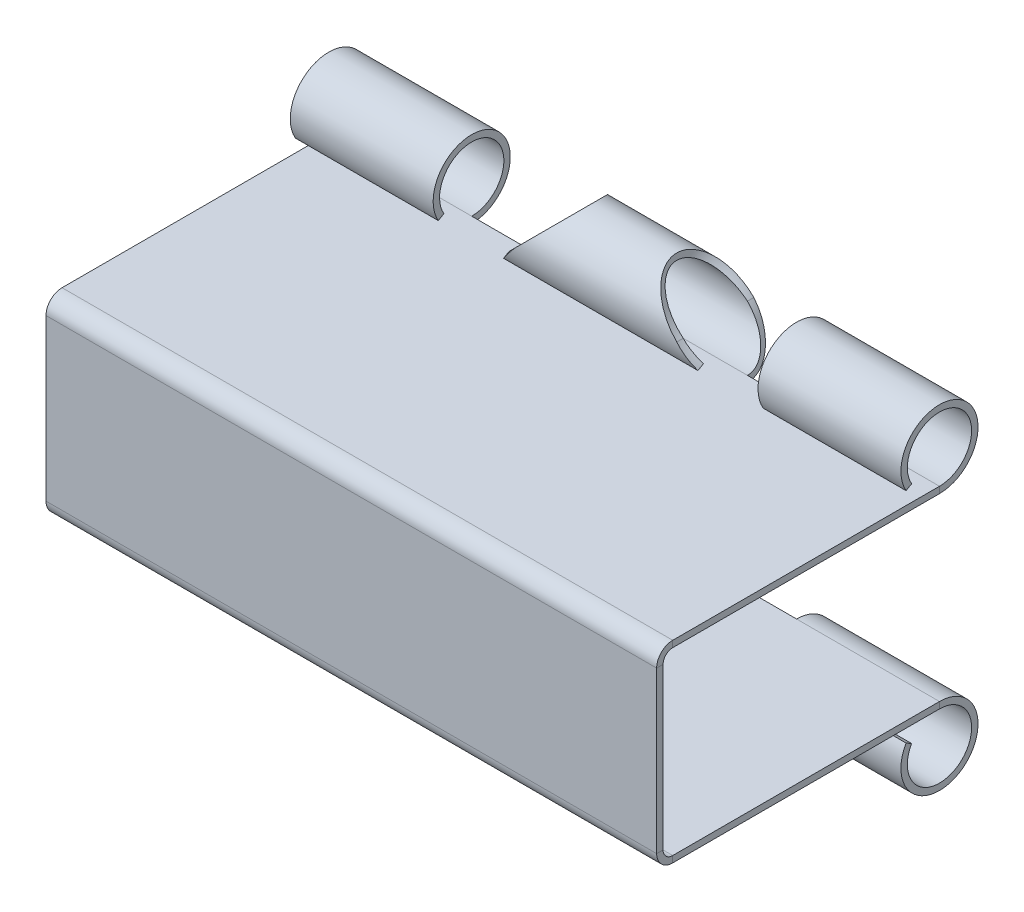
ISO-10303-21;
HEADER;
FILE_DESCRIPTION(('STEP AP214'),'2;1');
FILE_NAME('part.step','',(''),(''),'','','');
FILE_SCHEMA(('AUTOMOTIVE_DESIGN { 1 0 10303 214 1 1 1 1 }'));
ENDSEC;
DATA;
#1=APPLICATION_CONTEXT('core data for automotive mechanical design processes');
#2=APPLICATION_PROTOCOL_DEFINITION('international standard','automotive_design',2000,#1);
#3=PRODUCT_CONTEXT('',#1,'mechanical');
#4=PRODUCT('Part','Part','',(#3));
#5=PRODUCT_RELATED_PRODUCT_CATEGORY('part','',(#4));
#6=PRODUCT_DEFINITION_FORMATION('','',#4);
#7=PRODUCT_DEFINITION_CONTEXT('part definition',#1,'design');
#8=PRODUCT_DEFINITION('design','',#6,#7);
#9=PRODUCT_DEFINITION_SHAPE('','',#8);
#10=(LENGTH_UNIT() NAMED_UNIT(*) SI_UNIT(.MILLI.,.METRE.));
#11=(NAMED_UNIT(*) PLANE_ANGLE_UNIT() SI_UNIT($,.RADIAN.));
#12=(NAMED_UNIT(*) SI_UNIT($,.STERADIAN.) SOLID_ANGLE_UNIT());
#13=UNCERTAINTY_MEASURE_WITH_UNIT(LENGTH_MEASURE(1.E-05),#10,'distance_accuracy_value','');
#14=(GEOMETRIC_REPRESENTATION_CONTEXT(3) GLOBAL_UNCERTAINTY_ASSIGNED_CONTEXT((#13)) GLOBAL_UNIT_ASSIGNED_CONTEXT((#10,
#11,#12)) REPRESENTATION_CONTEXT('',''));
#15=CARTESIAN_POINT('',(0.,0.,0.));
#16=DIRECTION('',(0.,0.,1.));
#17=DIRECTION('',(1.,0.,0.));
#18=AXIS2_PLACEMENT_3D('',#15,#16,#17);
#19=CARTESIAN_POINT('',(0.,3.50000000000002,-7.93397459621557));
#20=DIRECTION('',(0.,0.866025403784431,0.500000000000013));
#21=DIRECTION('',(-1.,0.,0.));
#22=AXIS2_PLACEMENT_3D('',#19,#20,#21);
#23=PLANE('',#22);
#24=DIRECTION('',(-1.,0.,0.));
#25=VECTOR('',#24,1.);
#26=CARTESIAN_POINT('',(-9.5,3.40000000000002,-7.76076951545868));
#27=LINE('',#26,#25);
#28=CARTESIAN_POINT('',(9.5,3.40000000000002,-7.76076951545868));
#29=VERTEX_POINT('',#28);
#30=CARTESIAN_POINT('',(5.05418134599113,3.40000000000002,-7.76076951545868));
#31=VERTEX_POINT('',#30);
#32=EDGE_CURVE('E382',#29,#31,#27,.T.);
#33=ORIENTED_EDGE('',*,*,#32,.T.);
#34=DIRECTION('',(0.,-0.500000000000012,0.866025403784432));
#35=VECTOR('',#34,1.);
#36=CARTESIAN_POINT('',(5.05418134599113,3.40000000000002,-7.76076951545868));
#37=LINE('',#36,#35);
#38=CARTESIAN_POINT('',(5.05418134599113,3.50000000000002,-7.93397459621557));
#39=VERTEX_POINT('',#38);
#40=EDGE_CURVE('E928',#31,#39,#37,.F.);
#41=ORIENTED_EDGE('',*,*,#40,.T.);
#42=DIRECTION('',(-1.,0.,0.));
#43=VECTOR('',#42,1.);
#44=CARTESIAN_POINT('',(-9.5,3.50000000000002,-7.93397459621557));
#45=LINE('',#44,#43);
#46=CARTESIAN_POINT('',(9.5,3.50000000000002,-7.93397459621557));
#47=VERTEX_POINT('',#46);
#48=EDGE_CURVE('E400',#47,#39,#45,.T.);
#49=ORIENTED_EDGE('',*,*,#48,.F.);
#50=DIRECTION('',(0.,-0.500000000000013,0.866025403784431));
#51=VECTOR('',#50,1.);
#52=CARTESIAN_POINT('',(9.5,3.50000000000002,-7.93397459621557));
#53=LINE('',#52,#51);
#54=EDGE_CURVE('E408',#47,#29,#53,.T.);
#55=ORIENTED_EDGE('',*,*,#54,.T.);
#56=EDGE_LOOP('',(#33,#41,#49,#55));
#57=FACE_BOUND('',#56,.T.);
#58=ADVANCED_FACE('F78',(#57),#23,.F.);
#59=CARTESIAN_POINT('',(3.02468742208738,3.50000000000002,-7.93397459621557));
#60=VERTEX_POINT('',#59);
#61=CARTESIAN_POINT('',(-3.02468742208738,3.50000000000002,-7.93397459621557));
#62=VERTEX_POINT('',#61);
#63=EDGE_CURVE('E403',#60,#62,#45,.T.);
#64=ORIENTED_EDGE('',*,*,#63,.F.);
#65=DIRECTION('',(0.,0.500000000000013,-0.866025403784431));
#66=VECTOR('',#65,1.);
#67=CARTESIAN_POINT('',(3.02468742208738,3.50000000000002,-7.93397459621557));
#68=LINE('',#67,#66);
#69=CARTESIAN_POINT('',(3.02468742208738,3.40000000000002,-7.76076951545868));
#70=VERTEX_POINT('',#69);
#71=EDGE_CURVE('E353',#60,#70,#68,.F.);
#72=ORIENTED_EDGE('',*,*,#71,.T.);
#73=CARTESIAN_POINT('',(-3.02468742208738,3.40000000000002,-7.76076951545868));
#74=VERTEX_POINT('',#73);
#75=EDGE_CURVE('E385',#70,#74,#27,.T.);
#76=ORIENTED_EDGE('',*,*,#75,.T.);
#77=DIRECTION('',(0.,0.500000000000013,-0.866025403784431));
#78=VECTOR('',#77,1.);
#79=CARTESIAN_POINT('',(-3.02468742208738,3.50000000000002,-7.93397459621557));
#80=LINE('',#79,#78);
#81=EDGE_CURVE('E678',#62,#74,#80,.F.);
#82=ORIENTED_EDGE('',*,*,#81,.F.);
#83=EDGE_LOOP('',(#64,#72,#76,#82));
#84=FACE_BOUND('',#83,.T.);
#85=ADVANCED_FACE('F726',(#84),#23,.F.);
#86=CARTESIAN_POINT('',(-9.5,4.00000000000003,-8.8));
#87=DIRECTION('',(-1.,0.,0.));
#88=DIRECTION('',(0.,-0.500000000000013,0.866025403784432));
#89=AXIS2_PLACEMENT_3D('',#86,#87,#88);
#90=CYLINDRICAL_SURFACE('',#89,1.2);
#91=DIRECTION('',(-1.,0.,0.));
#92=VECTOR('',#91,1.);
#93=CARTESIAN_POINT('',(-9.5,2.80000000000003,-8.80000000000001));
#94=LINE('',#93,#92);
#95=CARTESIAN_POINT('',(5.05418134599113,2.80000000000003,-8.80000000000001));
#96=VERTEX_POINT('',#95);
#97=CARTESIAN_POINT('',(9.5,2.80000000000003,-8.80000000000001));
#98=VERTEX_POINT('',#97);
#99=EDGE_CURVE('E371',#96,#98,#94,.F.);
#100=ORIENTED_EDGE('',*,*,#99,.F.);
#101=CARTESIAN_POINT('',(5.05418134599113,4.00000000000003,-8.8));
#102=DIRECTION('',(1.,0.,0.));
#103=DIRECTION('',(0.,1.,0.));
#104=AXIS2_PLACEMENT_3D('',#101,#102,#103);
#105=CIRCLE('',#104,1.2);
#106=EDGE_CURVE('E924',#31,#96,#105,.F.);
#107=ORIENTED_EDGE('',*,*,#106,.F.);
#108=ORIENTED_EDGE('',*,*,#32,.F.);
#109=CARTESIAN_POINT('',(9.5,4.00000000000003,-8.8));
#110=DIRECTION('',(-1.,0.,0.));
#111=DIRECTION('',(0.,0.,1.));
#112=AXIS2_PLACEMENT_3D('',#109,#110,#111);
#113=CIRCLE('',#112,1.2);
#114=EDGE_CURVE('E373',#98,#29,#113,.F.);
#115=ORIENTED_EDGE('',*,*,#114,.F.);
#116=EDGE_LOOP('',(#100,#107,#108,#115));
#117=FACE_BOUND('',#116,.T.);
#118=ADVANCED_FACE('F732',(#117),#90,.T.);
#119=ORIENTED_EDGE('',*,*,#75,.F.);
#120=CARTESIAN_POINT('',(2.52468742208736,4.00000000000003,-8.8));
#121=DIRECTION('',(-0.768221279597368,-0.640184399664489,0.));
#122=DIRECTION('',(-0.640184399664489,0.768221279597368,0.));
#123=AXIS2_PLACEMENT_3D('',#120,#121,#122);
#124=ELLIPSE('',#123,1.56204993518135,1.2);
#125=CARTESIAN_POINT('',(2.52468742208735,4.00000000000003,-7.6));
#126=VERTEX_POINT('',#125);
#127=EDGE_CURVE('E364',#126,#70,#124,.F.);
#128=ORIENTED_EDGE('',*,*,#127,.F.);
#129=CARTESIAN_POINT('',(2.52468742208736,4.00000000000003,-8.8));
#130=DIRECTION('',(-0.707106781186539,-0.707106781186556,0.));
#131=DIRECTION('',(-0.707106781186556,0.707106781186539,0.));
#132=AXIS2_PLACEMENT_3D('',#129,#130,#131);
#133=ELLIPSE('',#132,1.69705627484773,1.2);
#134=CARTESIAN_POINT('',(2.52468742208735,4.00000000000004,-10.));
#135=VERTEX_POINT('',#134);
#136=EDGE_CURVE('E363',#135,#126,#133,.F.);
#137=ORIENTED_EDGE('',*,*,#136,.F.);
#138=CARTESIAN_POINT('',(3.52468742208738,2.80000000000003,-8.80000000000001));
#139=VERTEX_POINT('',#138);
#140=EDGE_CURVE('E343',#139,#135,#124,.F.);
#141=ORIENTED_EDGE('',*,*,#140,.F.);
#142=CARTESIAN_POINT('',(-3.52468742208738,2.80000000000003,-8.80000000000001));
#143=VERTEX_POINT('',#142);
#144=EDGE_CURVE('E360',#143,#139,#94,.F.);
#145=ORIENTED_EDGE('',*,*,#144,.F.);
#146=CARTESIAN_POINT('',(-2.52468742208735,4.00000000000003,-8.8));
#147=DIRECTION('',(0.768221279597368,-0.640184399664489,0.));
#148=DIRECTION('',(-0.640184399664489,-0.768221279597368,0.));
#149=AXIS2_PLACEMENT_3D('',#146,#147,#148);
#150=ELLIPSE('',#149,1.56204993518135,1.2);
#151=CARTESIAN_POINT('',(-2.52468742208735,4.00000000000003,-10.));
#152=VERTEX_POINT('',#151);
#153=EDGE_CURVE('E671',#152,#143,#150,.F.);
#154=ORIENTED_EDGE('',*,*,#153,.F.);
#155=CARTESIAN_POINT('',(-2.52468742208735,4.00000000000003,-8.8));
#156=DIRECTION('',(0.707106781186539,-0.707106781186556,0.));
#157=DIRECTION('',(-0.707106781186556,-0.707106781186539,0.));
#158=AXIS2_PLACEMENT_3D('',#155,#156,#157);
#159=ELLIPSE('',#158,1.69705627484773,1.2);
#160=CARTESIAN_POINT('',(-2.52468742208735,4.00000000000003,-7.6));
#161=VERTEX_POINT('',#160);
#162=EDGE_CURVE('E589',#161,#152,#159,.F.);
#163=ORIENTED_EDGE('',*,*,#162,.F.);
#164=EDGE_CURVE('E667',#74,#161,#150,.F.);
#165=ORIENTED_EDGE('',*,*,#164,.F.);
#166=EDGE_LOOP('',(#119,#128,#137,#141,#145,#154,#163,#165));
#167=FACE_BOUND('',#166,.T.);
#168=ADVANCED_FACE('F358',(#167),#90,.T.);
#169=CARTESIAN_POINT('',(-9.5,4.00000000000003,-8.8));
#170=DIRECTION('',(-1.,0.,0.));
#171=DIRECTION('',(0.,-0.500000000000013,0.866025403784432));
#172=AXIS2_PLACEMENT_3D('',#169,#170,#171);
#173=CYLINDRICAL_SURFACE('',#172,0.999999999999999);
#174=CARTESIAN_POINT('',(5.05418134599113,4.00000000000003,-8.8));
#175=DIRECTION('',(-1.,0.,0.));
#176=DIRECTION('',(0.,0.,1.));
#177=AXIS2_PLACEMENT_3D('',#174,#175,#176);
#178=CIRCLE('',#177,0.999999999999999);
#179=CARTESIAN_POINT('',(5.05418134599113,3.00000000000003,-8.8));
#180=VERTEX_POINT('',#179);
#181=EDGE_CURVE('E929',#39,#180,#178,.T.);
#182=ORIENTED_EDGE('',*,*,#181,.T.);
#183=DIRECTION('',(-1.,0.,0.));
#184=VECTOR('',#183,1.);
#185=CARTESIAN_POINT('',(-9.5,3.00000000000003,-8.8));
#186=LINE('',#185,#184);
#187=CARTESIAN_POINT('',(9.5,3.00000000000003,-8.8));
#188=VERTEX_POINT('',#187);
#189=EDGE_CURVE('E396',#180,#188,#186,.F.);
#190=ORIENTED_EDGE('',*,*,#189,.T.);
#191=CARTESIAN_POINT('',(9.5,4.00000000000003,-8.8));
#192=DIRECTION('',(-1.,0.,0.));
#193=DIRECTION('',(0.,0.,1.));
#194=AXIS2_PLACEMENT_3D('',#191,#192,#193);
#195=CIRCLE('',#194,0.999999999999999);
#196=EDGE_CURVE('E389',#188,#47,#195,.F.);
#197=ORIENTED_EDGE('',*,*,#196,.T.);
#198=ORIENTED_EDGE('',*,*,#48,.T.);
#199=EDGE_LOOP('',(#182,#190,#197,#198));
#200=FACE_BOUND('',#199,.T.);
#201=ADVANCED_FACE('F1205',(#200),#173,.F.);
#202=CARTESIAN_POINT('',(2.52468742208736,4.00000000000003,-8.8));
#203=DIRECTION('',(-0.707106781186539,-0.707106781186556,0.));
#204=DIRECTION('',(-0.707106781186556,0.707106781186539,0.));
#205=AXIS2_PLACEMENT_3D('',#202,#203,#204);
#206=ELLIPSE('',#205,1.41421356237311,0.999999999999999);
#207=CARTESIAN_POINT('',(2.52468742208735,4.00000000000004,-7.8));
#208=VERTEX_POINT('',#207);
#209=EDGE_CURVE('E1514',#208,#60,#206,.F.);
#210=ORIENTED_EDGE('',*,*,#209,.T.);
#211=ORIENTED_EDGE('',*,*,#63,.T.);
#212=CARTESIAN_POINT('',(-2.52468742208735,4.00000000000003,-8.8));
#213=DIRECTION('',(0.707106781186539,-0.707106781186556,0.));
#214=DIRECTION('',(-0.707106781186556,-0.707106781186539,0.));
#215=AXIS2_PLACEMENT_3D('',#212,#213,#214);
#216=ELLIPSE('',#215,1.41421356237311,0.999999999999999);
#217=CARTESIAN_POINT('',(-2.52468742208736,4.00000000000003,-7.8));
#218=VERTEX_POINT('',#217);
#219=EDGE_CURVE('E673',#62,#218,#216,.F.);
#220=ORIENTED_EDGE('',*,*,#219,.T.);
#221=CARTESIAN_POINT('',(-2.52468742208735,4.00000000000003,-8.8));
#222=DIRECTION('',(0.640184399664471,-0.768221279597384,0.));
#223=DIRECTION('',(-0.768221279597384,-0.640184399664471,0.));
#224=AXIS2_PLACEMENT_3D('',#221,#222,#223);
#225=ELLIPSE('',#224,1.56204993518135,0.999999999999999);
#226=CARTESIAN_POINT('',(-2.52468742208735,4.00000000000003,-9.8));
#227=VERTEX_POINT('',#226);
#228=EDGE_CURVE('E591',#218,#227,#225,.F.);
#229=ORIENTED_EDGE('',*,*,#228,.T.);
#230=CARTESIAN_POINT('',(-3.52468742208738,3.00000000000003,-8.8));
#231=VERTEX_POINT('',#230);
#232=EDGE_CURVE('E675',#227,#231,#216,.F.);
#233=ORIENTED_EDGE('',*,*,#232,.T.);
#234=CARTESIAN_POINT('',(3.52468742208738,3.00000000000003,-8.8));
#235=VERTEX_POINT('',#234);
#236=EDGE_CURVE('E395',#231,#235,#186,.F.);
#237=ORIENTED_EDGE('',*,*,#236,.T.);
#238=CARTESIAN_POINT('',(2.52468742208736,4.00000000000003,-9.8));
#239=VERTEX_POINT('',#238);
#240=EDGE_CURVE('E352',#235,#239,#206,.F.);
#241=ORIENTED_EDGE('',*,*,#240,.T.);
#242=CARTESIAN_POINT('',(2.52468742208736,4.00000000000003,-8.8));
#243=DIRECTION('',(-0.640184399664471,-0.768221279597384,0.));
#244=DIRECTION('',(-0.768221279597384,0.640184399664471,0.));
#245=AXIS2_PLACEMENT_3D('',#242,#243,#244);
#246=ELLIPSE('',#245,1.56204993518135,0.999999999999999);
#247=EDGE_CURVE('E925',#239,#208,#246,.F.);
#248=ORIENTED_EDGE('',*,*,#247,.T.);
#249=EDGE_LOOP('',(#210,#211,#220,#229,#233,#237,#241,#248));
#250=FACE_BOUND('',#249,.T.);
#251=ADVANCED_FACE('F1206',(#250),#173,.F.);
#252=CARTESIAN_POINT('',(0.,-3.50000000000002,-7.93397459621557));
#253=DIRECTION('',(0.,-0.866025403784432,0.500000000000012));
#254=DIRECTION('',(1.,0.,0.));
#255=AXIS2_PLACEMENT_3D('',#252,#253,#254);
#256=PLANE('',#255);
#257=DIRECTION('',(1.,0.,0.));
#258=VECTOR('',#257,1.);
#259=CARTESIAN_POINT('',(9.50000000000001,-3.40000000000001,-7.76076951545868));
#260=LINE('',#259,#258);
#261=CARTESIAN_POINT('',(-9.5,-3.40000000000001,-7.76076951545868));
#262=VERTEX_POINT('',#261);
#263=CARTESIAN_POINT('',(-5.05418134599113,-3.40000000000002,-7.76076951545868));
#264=VERTEX_POINT('',#263);
#265=EDGE_CURVE('E609',#262,#264,#260,.T.);
#266=ORIENTED_EDGE('',*,*,#265,.T.);
#267=DIRECTION('',(0.,0.500000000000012,0.866025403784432));
#268=VECTOR('',#267,1.);
#269=CARTESIAN_POINT('',(-5.05418134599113,-3.40000000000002,-7.76076951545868));
#270=LINE('',#269,#268);
#271=CARTESIAN_POINT('',(-5.05418134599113,-3.50000000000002,-7.93397459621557));
#272=VERTEX_POINT('',#271);
#273=EDGE_CURVE('E807',#264,#272,#270,.F.);
#274=ORIENTED_EDGE('',*,*,#273,.T.);
#275=DIRECTION('',(1.,0.,0.));
#276=VECTOR('',#275,1.);
#277=CARTESIAN_POINT('',(9.50000000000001,-3.50000000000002,-7.93397459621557));
#278=LINE('',#277,#276);
#279=CARTESIAN_POINT('',(-9.5,-3.50000000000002,-7.93397459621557));
#280=VERTEX_POINT('',#279);
#281=EDGE_CURVE('E627',#280,#272,#278,.T.);
#282=ORIENTED_EDGE('',*,*,#281,.F.);
#283=DIRECTION('',(0.,0.500000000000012,0.866025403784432));
#284=VECTOR('',#283,1.);
#285=CARTESIAN_POINT('',(-9.5,-3.50000000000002,-7.93397459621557));
#286=LINE('',#285,#284);
#287=EDGE_CURVE('E634',#280,#262,#286,.T.);
#288=ORIENTED_EDGE('',*,*,#287,.T.);
#289=EDGE_LOOP('',(#266,#274,#282,#288));
#290=FACE_BOUND('',#289,.T.);
#291=ADVANCED_FACE('F762',(#290),#256,.F.);
#292=CARTESIAN_POINT('',(-3.02468742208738,-3.50000000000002,-7.93397459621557));
#293=VERTEX_POINT('',#292);
#294=CARTESIAN_POINT('',(3.02468742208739,-3.50000000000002,-7.93397459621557));
#295=VERTEX_POINT('',#294);
#296=EDGE_CURVE('E630',#293,#295,#278,.T.);
#297=ORIENTED_EDGE('',*,*,#296,.F.);
#298=DIRECTION('',(0.,-0.500000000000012,-0.866025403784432));
#299=VECTOR('',#298,1.);
#300=CARTESIAN_POINT('',(-3.02468742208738,-3.50000000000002,-7.93397459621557));
#301=LINE('',#300,#299);
#302=CARTESIAN_POINT('',(-3.02468742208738,-3.40000000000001,-7.76076951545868));
#303=VERTEX_POINT('',#302);
#304=EDGE_CURVE('E781',#293,#303,#301,.F.);
#305=ORIENTED_EDGE('',*,*,#304,.T.);
#306=CARTESIAN_POINT('',(3.02468742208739,-3.40000000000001,-7.76076951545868));
#307=VERTEX_POINT('',#306);
#308=EDGE_CURVE('E613',#303,#307,#260,.T.);
#309=ORIENTED_EDGE('',*,*,#308,.T.);
#310=DIRECTION('',(0.,-0.500000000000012,-0.866025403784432));
#311=VECTOR('',#310,1.);
#312=CARTESIAN_POINT('',(3.02468742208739,-3.50000000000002,-7.93397459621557));
#313=LINE('',#312,#311);
#314=EDGE_CURVE('E784',#295,#307,#313,.F.);
#315=ORIENTED_EDGE('',*,*,#314,.F.);
#316=EDGE_LOOP('',(#297,#305,#309,#315));
#317=FACE_BOUND('',#316,.T.);
#318=ADVANCED_FACE('F763',(#317),#256,.F.);
#319=CARTESIAN_POINT('',(9.50000000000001,-4.00000000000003,-8.8));
#320=DIRECTION('',(1.,0.,0.));
#321=DIRECTION('',(0.,0.500000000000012,0.866025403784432));
#322=AXIS2_PLACEMENT_3D('',#319,#320,#321);
#323=CYLINDRICAL_SURFACE('',#322,1.2);
#324=DIRECTION('',(1.,0.,0.));
#325=VECTOR('',#324,1.);
#326=CARTESIAN_POINT('',(9.50000000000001,-2.80000000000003,-8.80000000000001));
#327=LINE('',#326,#325);
#328=CARTESIAN_POINT('',(-5.05418134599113,-2.80000000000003,-8.80000000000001));
#329=VERTEX_POINT('',#328);
#330=CARTESIAN_POINT('',(-9.5,-2.80000000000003,-8.80000000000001));
#331=VERTEX_POINT('',#330);
#332=EDGE_CURVE('E606',#329,#331,#327,.F.);
#333=ORIENTED_EDGE('',*,*,#332,.F.);
#334=CARTESIAN_POINT('',(-5.05418134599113,-4.00000000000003,-8.8));
#335=DIRECTION('',(-1.,0.,0.));
#336=DIRECTION('',(0.,-1.,0.));
#337=AXIS2_PLACEMENT_3D('',#334,#335,#336);
#338=CIRCLE('',#337,1.2);
#339=EDGE_CURVE('E863',#264,#329,#338,.F.);
#340=ORIENTED_EDGE('',*,*,#339,.F.);
#341=ORIENTED_EDGE('',*,*,#265,.F.);
#342=CARTESIAN_POINT('',(-9.5,-4.00000000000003,-8.8));
#343=DIRECTION('',(1.,0.,0.));
#344=DIRECTION('',(0.,0.,-1.));
#345=AXIS2_PLACEMENT_3D('',#342,#343,#344);
#346=CIRCLE('',#345,1.2);
#347=EDGE_CURVE('E604',#331,#262,#346,.F.);
#348=ORIENTED_EDGE('',*,*,#347,.F.);
#349=EDGE_LOOP('',(#333,#340,#341,#348));
#350=FACE_BOUND('',#349,.T.);
#351=ADVANCED_FACE('F751',(#350),#323,.T.);
#352=ORIENTED_EDGE('',*,*,#308,.F.);
#353=CARTESIAN_POINT('',(-2.52468742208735,-4.00000000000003,-8.8));
#354=DIRECTION('',(0.768221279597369,0.640184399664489,0.));
#355=DIRECTION('',(0.640184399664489,-0.768221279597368,0.));
#356=AXIS2_PLACEMENT_3D('',#353,#354,#355);
#357=ELLIPSE('',#356,1.56204993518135,1.2);
#358=CARTESIAN_POINT('',(-2.52468742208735,-4.00000000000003,-7.6));
#359=VERTEX_POINT('',#358);
#360=EDGE_CURVE('E942',#359,#303,#357,.F.);
#361=ORIENTED_EDGE('',*,*,#360,.F.);
#362=CARTESIAN_POINT('',(-2.52468742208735,-4.00000000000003,-8.8));
#363=DIRECTION('',(0.707106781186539,0.707106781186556,0.));
#364=DIRECTION('',(0.707106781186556,-0.707106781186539,0.));
#365=AXIS2_PLACEMENT_3D('',#362,#363,#364);
#366=ELLIPSE('',#365,1.69705627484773,1.2);
#367=CARTESIAN_POINT('',(-2.52468742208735,-4.00000000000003,-10.));
#368=VERTEX_POINT('',#367);
#369=EDGE_CURVE('E860',#368,#359,#366,.F.);
#370=ORIENTED_EDGE('',*,*,#369,.F.);
#371=CARTESIAN_POINT('',(-3.52468742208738,-2.80000000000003,-8.80000000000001));
#372=VERTEX_POINT('',#371);
#373=EDGE_CURVE('E940',#372,#368,#357,.F.);
#374=ORIENTED_EDGE('',*,*,#373,.F.);
#375=CARTESIAN_POINT('',(3.52468742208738,-2.80000000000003,-8.80000000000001));
#376=VERTEX_POINT('',#375);
#377=EDGE_CURVE('E605',#376,#372,#327,.F.);
#378=ORIENTED_EDGE('',*,*,#377,.F.);
#379=CARTESIAN_POINT('',(2.52468742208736,-4.00000000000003,-8.8));
#380=DIRECTION('',(-0.768221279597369,0.640184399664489,0.));
#381=DIRECTION('',(0.640184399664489,0.768221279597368,0.));
#382=AXIS2_PLACEMENT_3D('',#379,#380,#381);
#383=ELLIPSE('',#382,1.56204993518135,1.2);
#384=CARTESIAN_POINT('',(2.52468742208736,-4.00000000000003,-10.));
#385=VERTEX_POINT('',#384);
#386=EDGE_CURVE('E851',#385,#376,#383,.F.);
#387=ORIENTED_EDGE('',*,*,#386,.F.);
#388=CARTESIAN_POINT('',(2.52468742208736,-4.00000000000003,-8.8));
#389=DIRECTION('',(-0.707106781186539,0.707106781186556,0.));
#390=DIRECTION('',(0.707106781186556,0.707106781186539,0.));
#391=AXIS2_PLACEMENT_3D('',#388,#389,#390);
#392=ELLIPSE('',#391,1.69705627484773,1.2);
#393=CARTESIAN_POINT('',(2.52468742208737,-4.00000000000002,-7.6));
#394=VERTEX_POINT('',#393);
#395=EDGE_CURVE('E652',#394,#385,#392,.F.);
#396=ORIENTED_EDGE('',*,*,#395,.F.);
#397=EDGE_CURVE('E795',#307,#394,#383,.F.);
#398=ORIENTED_EDGE('',*,*,#397,.F.);
#399=EDGE_LOOP('',(#352,#361,#370,#374,#378,#387,#396,#398));
#400=FACE_BOUND('',#399,.T.);
#401=ADVANCED_FACE('F752',(#400),#323,.T.);
#402=CARTESIAN_POINT('',(9.50000000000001,-4.00000000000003,-8.8));
#403=DIRECTION('',(1.,0.,0.));
#404=DIRECTION('',(0.,0.500000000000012,0.866025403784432));
#405=AXIS2_PLACEMENT_3D('',#402,#403,#404);
#406=CYLINDRICAL_SURFACE('',#405,1.);
#407=CARTESIAN_POINT('',(-5.05418134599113,-4.00000000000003,-8.8));
#408=DIRECTION('',(1.,0.,0.));
#409=DIRECTION('',(0.,0.,-1.));
#410=AXIS2_PLACEMENT_3D('',#407,#408,#409);
#411=CIRCLE('',#410,1.);
#412=CARTESIAN_POINT('',(-5.05418134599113,-3.00000000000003,-8.8));
#413=VERTEX_POINT('',#412);
#414=EDGE_CURVE('E862',#272,#413,#411,.T.);
#415=ORIENTED_EDGE('',*,*,#414,.T.);
#416=DIRECTION('',(1.,0.,0.));
#417=VECTOR('',#416,1.);
#418=CARTESIAN_POINT('',(9.50000000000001,-3.00000000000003,-8.8));
#419=LINE('',#418,#417);
#420=CARTESIAN_POINT('',(-9.5,-3.00000000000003,-8.8));
#421=VERTEX_POINT('',#420);
#422=EDGE_CURVE('E624',#413,#421,#419,.F.);
#423=ORIENTED_EDGE('',*,*,#422,.T.);
#424=CARTESIAN_POINT('',(-9.5,-4.00000000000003,-8.8));
#425=DIRECTION('',(1.,0.,0.));
#426=DIRECTION('',(0.,0.,-1.));
#427=AXIS2_PLACEMENT_3D('',#424,#425,#426);
#428=CIRCLE('',#427,1.);
#429=EDGE_CURVE('E617',#421,#280,#428,.F.);
#430=ORIENTED_EDGE('',*,*,#429,.T.);
#431=ORIENTED_EDGE('',*,*,#281,.T.);
#432=EDGE_LOOP('',(#415,#423,#430,#431));
#433=FACE_BOUND('',#432,.T.);
#434=ADVANCED_FACE('F745',(#433),#406,.F.);
#435=CARTESIAN_POINT('',(-2.52468742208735,-4.00000000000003,-8.8));
#436=DIRECTION('',(0.707106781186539,0.707106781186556,0.));
#437=DIRECTION('',(0.707106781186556,-0.707106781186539,0.));
#438=AXIS2_PLACEMENT_3D('',#435,#436,#437);
#439=ELLIPSE('',#438,1.41421356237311,1.);
#440=CARTESIAN_POINT('',(-2.52468742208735,-4.00000000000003,-7.8));
#441=VERTEX_POINT('',#440);
#442=EDGE_CURVE('E767',#441,#293,#439,.F.);
#443=ORIENTED_EDGE('',*,*,#442,.T.);
#444=ORIENTED_EDGE('',*,*,#296,.T.);
#445=CARTESIAN_POINT('',(2.52468742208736,-4.00000000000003,-8.8));
#446=DIRECTION('',(-0.707106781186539,0.707106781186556,0.));
#447=DIRECTION('',(0.707106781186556,0.707106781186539,0.));
#448=AXIS2_PLACEMENT_3D('',#445,#446,#447);
#449=ELLIPSE('',#448,1.41421356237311,1.);
#450=CARTESIAN_POINT('',(2.52468742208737,-4.00000000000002,-7.8));
#451=VERTEX_POINT('',#450);
#452=EDGE_CURVE('E804',#295,#451,#449,.F.);
#453=ORIENTED_EDGE('',*,*,#452,.T.);
#454=CARTESIAN_POINT('',(2.52468742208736,-4.00000000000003,-8.8));
#455=DIRECTION('',(-0.640184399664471,0.768221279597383,0.));
#456=DIRECTION('',(0.768221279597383,0.640184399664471,0.));
#457=AXIS2_PLACEMENT_3D('',#454,#455,#456);
#458=ELLIPSE('',#457,1.56204993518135,1.);
#459=CARTESIAN_POINT('',(2.52468742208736,-4.00000000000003,-9.8));
#460=VERTEX_POINT('',#459);
#461=EDGE_CURVE('E655',#451,#460,#458,.F.);
#462=ORIENTED_EDGE('',*,*,#461,.T.);
#463=CARTESIAN_POINT('',(3.52468742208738,-3.00000000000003,-8.8));
#464=VERTEX_POINT('',#463);
#465=EDGE_CURVE('E800',#460,#464,#449,.F.);
#466=ORIENTED_EDGE('',*,*,#465,.T.);
#467=CARTESIAN_POINT('',(-3.52468742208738,-3.00000000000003,-8.8));
#468=VERTEX_POINT('',#467);
#469=EDGE_CURVE('E623',#464,#468,#419,.F.);
#470=ORIENTED_EDGE('',*,*,#469,.T.);
#471=CARTESIAN_POINT('',(-2.52468742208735,-4.00000000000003,-9.8));
#472=VERTEX_POINT('',#471);
#473=EDGE_CURVE('E775',#468,#472,#439,.F.);
#474=ORIENTED_EDGE('',*,*,#473,.T.);
#475=CARTESIAN_POINT('',(-2.52468742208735,-4.00000000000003,-8.8));
#476=DIRECTION('',(0.640184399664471,0.768221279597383,0.));
#477=DIRECTION('',(0.768221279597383,-0.640184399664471,0.));
#478=AXIS2_PLACEMENT_3D('',#475,#476,#477);
#479=ELLIPSE('',#478,1.56204993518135,1.);
#480=EDGE_CURVE('E772',#472,#441,#479,.F.);
#481=ORIENTED_EDGE('',*,*,#480,.T.);
#482=EDGE_LOOP('',(#443,#444,#453,#462,#466,#470,#474,#481));
#483=FACE_BOUND('',#482,.T.);
#484=ADVANCED_FACE('F746',(#483),#406,.F.);
#485=CARTESIAN_POINT('',(5.05418134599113,-3.50000000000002,-7.93397459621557));
#486=VERTEX_POINT('',#485);
#487=CARTESIAN_POINT('',(9.50000000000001,-3.50000000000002,-7.93397459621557));
#488=VERTEX_POINT('',#487);
#489=EDGE_CURVE('E602',#486,#488,#278,.T.);
#490=ORIENTED_EDGE('',*,*,#489,.F.);
#491=DIRECTION('',(0.,0.500000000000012,0.866025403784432));
#492=VECTOR('',#491,1.);
#493=CARTESIAN_POINT('',(5.05418134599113,-3.40000000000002,-7.76076951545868));
#494=LINE('',#493,#492);
#495=CARTESIAN_POINT('',(5.05418134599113,-3.40000000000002,-7.76076951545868));
#496=VERTEX_POINT('',#495);
#497=EDGE_CURVE('E664',#496,#486,#494,.F.);
#498=ORIENTED_EDGE('',*,*,#497,.F.);
#499=CARTESIAN_POINT('',(9.50000000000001,-3.40000000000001,-7.76076951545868));
#500=VERTEX_POINT('',#499);
#501=EDGE_CURVE('E614',#496,#500,#260,.T.);
#502=ORIENTED_EDGE('',*,*,#501,.T.);
#503=DIRECTION('',(0.,0.500000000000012,0.866025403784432));
#504=VECTOR('',#503,1.);
#505=CARTESIAN_POINT('',(9.50000000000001,-3.50000000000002,-7.93397459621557));
#506=LINE('',#505,#504);
#507=EDGE_CURVE('E580',#488,#500,#506,.T.);
#508=ORIENTED_EDGE('',*,*,#507,.F.);
#509=EDGE_LOOP('',(#490,#498,#502,#508));
#510=FACE_BOUND('',#509,.T.);
#511=ADVANCED_FACE('F750',(#510),#256,.F.);
#512=ORIENTED_EDGE('',*,*,#501,.F.);
#513=CARTESIAN_POINT('',(5.05418134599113,-4.00000000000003,-8.8));
#514=DIRECTION('',(1.,0.,0.));
#515=DIRECTION('',(0.,1.,0.));
#516=AXIS2_PLACEMENT_3D('',#513,#514,#515);
#517=CIRCLE('',#516,1.2);
#518=CARTESIAN_POINT('',(5.05418134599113,-2.80000000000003,-8.80000000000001));
#519=VERTEX_POINT('',#518);
#520=EDGE_CURVE('E647',#519,#496,#517,.F.);
#521=ORIENTED_EDGE('',*,*,#520,.F.);
#522=CARTESIAN_POINT('',(9.50000000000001,-2.80000000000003,-8.80000000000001));
#523=VERTEX_POINT('',#522);
#524=EDGE_CURVE('E543',#523,#519,#327,.F.);
#525=ORIENTED_EDGE('',*,*,#524,.F.);
#526=CARTESIAN_POINT('',(9.50000000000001,-4.00000000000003,-8.8));
#527=DIRECTION('',(1.,0.,0.));
#528=DIRECTION('',(0.,0.,-1.));
#529=AXIS2_PLACEMENT_3D('',#526,#527,#528);
#530=CIRCLE('',#529,1.2);
#531=EDGE_CURVE('E612',#500,#523,#530,.T.);
#532=ORIENTED_EDGE('',*,*,#531,.F.);
#533=EDGE_LOOP('',(#512,#521,#525,#532));
#534=FACE_BOUND('',#533,.T.);
#535=ADVANCED_FACE('F645',(#534),#323,.T.);
#536=CARTESIAN_POINT('',(5.05418134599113,-4.00000000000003,-8.8));
#537=DIRECTION('',(1.,0.,0.));
#538=DIRECTION('',(0.,0.,-1.));
#539=AXIS2_PLACEMENT_3D('',#536,#537,#538);
#540=CIRCLE('',#539,1.);
#541=CARTESIAN_POINT('',(5.05418134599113,-3.00000000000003,-8.8));
#542=VERTEX_POINT('',#541);
#543=EDGE_CURVE('E651',#542,#486,#540,.F.);
#544=ORIENTED_EDGE('',*,*,#543,.T.);
#545=ORIENTED_EDGE('',*,*,#489,.T.);
#546=CARTESIAN_POINT('',(9.50000000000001,-4.00000000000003,-8.8));
#547=DIRECTION('',(1.,0.,0.));
#548=DIRECTION('',(0.,0.,-1.));
#549=AXIS2_PLACEMENT_3D('',#546,#547,#548);
#550=CIRCLE('',#549,1.);
#551=CARTESIAN_POINT('',(9.5,-3.00000000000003,-8.8));
#552=VERTEX_POINT('',#551);
#553=EDGE_CURVE('E625',#488,#552,#550,.T.);
#554=ORIENTED_EDGE('',*,*,#553,.T.);
#555=EDGE_CURVE('E620',#552,#542,#419,.F.);
#556=ORIENTED_EDGE('',*,*,#555,.T.);
#557=EDGE_LOOP('',(#544,#545,#554,#556));
#558=FACE_BOUND('',#557,.T.);
#559=ADVANCED_FACE('F737',(#558),#406,.F.);
#560=CARTESIAN_POINT('',(-5.05418134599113,3.50000000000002,-7.93397459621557));
#561=VERTEX_POINT('',#560);
#562=CARTESIAN_POINT('',(-9.5,3.50000000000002,-7.93397459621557));
#563=VERTEX_POINT('',#562);
#564=EDGE_CURVE('E404',#561,#563,#45,.T.);
#565=ORIENTED_EDGE('',*,*,#564,.F.);
#566=DIRECTION('',(0.,-0.500000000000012,0.866025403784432));
#567=VECTOR('',#566,1.);
#568=CARTESIAN_POINT('',(-5.05418134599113,3.40000000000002,-7.76076951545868));
#569=LINE('',#568,#567);
#570=CARTESIAN_POINT('',(-5.05418134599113,3.40000000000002,-7.76076951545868));
#571=VERTEX_POINT('',#570);
#572=EDGE_CURVE('E600',#571,#561,#569,.F.);
#573=ORIENTED_EDGE('',*,*,#572,.F.);
#574=CARTESIAN_POINT('',(-9.5,3.40000000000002,-7.76076951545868));
#575=VERTEX_POINT('',#574);
#576=EDGE_CURVE('E386',#571,#575,#27,.T.);
#577=ORIENTED_EDGE('',*,*,#576,.T.);
#578=DIRECTION('',(0.,-0.500000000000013,0.866025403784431));
#579=VECTOR('',#578,1.);
#580=CARTESIAN_POINT('',(-9.5,3.50000000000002,-7.93397459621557));
#581=LINE('',#580,#579);
#582=EDGE_CURVE('E410',#563,#575,#581,.T.);
#583=ORIENTED_EDGE('',*,*,#582,.F.);
#584=EDGE_LOOP('',(#565,#573,#577,#583));
#585=FACE_BOUND('',#584,.T.);
#586=ADVANCED_FACE('F581',(#585),#23,.F.);
#587=ORIENTED_EDGE('',*,*,#576,.F.);
#588=CARTESIAN_POINT('',(-5.05418134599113,4.00000000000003,-8.8));
#589=DIRECTION('',(-1.,0.,0.));
#590=DIRECTION('',(0.,-1.,0.));
#591=AXIS2_PLACEMENT_3D('',#588,#589,#590);
#592=CIRCLE('',#591,1.2);
#593=CARTESIAN_POINT('',(-5.05418134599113,2.80000000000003,-8.80000000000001));
#594=VERTEX_POINT('',#593);
#595=EDGE_CURVE('E586',#594,#571,#592,.F.);
#596=ORIENTED_EDGE('',*,*,#595,.F.);
#597=CARTESIAN_POINT('',(-9.5,2.80000000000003,-8.8));
#598=VERTEX_POINT('',#597);
#599=EDGE_CURVE('E370',#598,#594,#94,.F.);
#600=ORIENTED_EDGE('',*,*,#599,.F.);
#601=CARTESIAN_POINT('',(-9.5,4.00000000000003,-8.8));
#602=DIRECTION('',(-1.,0.,0.));
#603=DIRECTION('',(0.,0.,1.));
#604=AXIS2_PLACEMENT_3D('',#601,#602,#603);
#605=CIRCLE('',#604,1.2);
#606=EDGE_CURVE('E374',#575,#598,#605,.T.);
#607=ORIENTED_EDGE('',*,*,#606,.F.);
#608=EDGE_LOOP('',(#587,#596,#600,#607));
#609=FACE_BOUND('',#608,.T.);
#610=ADVANCED_FACE('F584',(#609),#90,.T.);
#611=CARTESIAN_POINT('',(-5.05418134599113,4.00000000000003,-8.8));
#612=DIRECTION('',(-1.,0.,0.));
#613=DIRECTION('',(0.,0.,1.));
#614=AXIS2_PLACEMENT_3D('',#611,#612,#613);
#615=CIRCLE('',#614,0.999999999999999);
#616=CARTESIAN_POINT('',(-5.05418134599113,3.00000000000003,-8.8));
#617=VERTEX_POINT('',#616);
#618=EDGE_CURVE('E577',#617,#561,#615,.F.);
#619=ORIENTED_EDGE('',*,*,#618,.T.);
#620=ORIENTED_EDGE('',*,*,#564,.T.);
#621=CARTESIAN_POINT('',(-9.5,4.00000000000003,-8.8));
#622=DIRECTION('',(-1.,0.,0.));
#623=DIRECTION('',(0.,0.,1.));
#624=AXIS2_PLACEMENT_3D('',#621,#622,#623);
#625=CIRCLE('',#624,0.999999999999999);
#626=CARTESIAN_POINT('',(-9.5,3.00000000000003,-8.8));
#627=VERTEX_POINT('',#626);
#628=EDGE_CURVE('E397',#563,#627,#625,.T.);
#629=ORIENTED_EDGE('',*,*,#628,.T.);
#630=EDGE_CURVE('E392',#627,#617,#186,.F.);
#631=ORIENTED_EDGE('',*,*,#630,.T.);
#632=EDGE_LOOP('',(#619,#620,#629,#631));
#633=FACE_BOUND('',#632,.T.);
#634=ADVANCED_FACE('F574',(#633),#173,.F.);
#635=CARTESIAN_POINT('',(9.5,-3.,-0.199999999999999));
#636=DIRECTION('',(1.,0.,0.));
#637=DIRECTION('',(0.,0.,-1.));
#638=AXIS2_PLACEMENT_3D('',#635,#636,#637);
#639=PLANE('',#638);
#640=DIRECTION('',(0.,0.,1.));
#641=VECTOR('',#640,1.);
#642=CARTESIAN_POINT('',(9.5,-3.,-0.199999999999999));
#643=LINE('',#642,#641);
#644=CARTESIAN_POINT('',(9.5,-3.,-0.499999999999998));
#645=VERTEX_POINT('',#644);
#646=EDGE_CURVE('E418',#645,#552,#643,.F.);
#647=ORIENTED_EDGE('',*,*,#646,.T.);
#648=DIRECTION('',(0.,1.,0.));
#649=VECTOR('',#648,1.);
#650=CARTESIAN_POINT('',(9.50000000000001,-3.00000000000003,-8.8));
#651=LINE('',#650,#649);
#652=EDGE_CURVE('E377',#552,#523,#651,.T.);
#653=ORIENTED_EDGE('',*,*,#652,.T.);
#654=DIRECTION('',(0.,0.,-1.));
#655=VECTOR('',#654,1.);
#656=CARTESIAN_POINT('',(9.5,-2.8,0.));
#657=LINE('',#656,#655);
#658=CARTESIAN_POINT('',(9.5,-2.8,-0.499999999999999));
#659=VERTEX_POINT('',#658);
#660=EDGE_CURVE('E423',#659,#523,#657,.T.);
#661=ORIENTED_EDGE('',*,*,#660,.F.);
#662=DIRECTION('',(0.,-1.,0.));
#663=VECTOR('',#662,1.);
#664=CARTESIAN_POINT('',(9.5,-3.,-0.499999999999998));
#665=LINE('',#664,#663);
#666=EDGE_CURVE('E413',#659,#645,#665,.T.);
#667=ORIENTED_EDGE('',*,*,#666,.T.);
#668=EDGE_LOOP('',(#647,#653,#661,#667));
#669=FACE_BOUND('',#668,.T.);
#670=ADVANCED_FACE('F535',(#669),#639,.T.);
#671=CARTESIAN_POINT('',(-9.5,3.00000000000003,-10.));
#672=DIRECTION('',(-1.,0.,0.));
#673=DIRECTION('',(0.,0.,1.));
#674=AXIS2_PLACEMENT_3D('',#671,#672,#673);
#675=PLANE('',#674);
#676=DIRECTION('',(0.,0.,-1.));
#677=VECTOR('',#676,1.);
#678=CARTESIAN_POINT('',(-9.5,3.00000000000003,-10.));
#679=LINE('',#678,#677);
#680=CARTESIAN_POINT('',(-9.5,3.,-0.499999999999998));
#681=VERTEX_POINT('',#680);
#682=EDGE_CURVE('E462',#681,#627,#679,.T.);
#683=ORIENTED_EDGE('',*,*,#682,.T.);
#684=DIRECTION('',(0.,-1.,0.));
#685=VECTOR('',#684,1.);
#686=CARTESIAN_POINT('',(-9.5,3.00000000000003,-8.8));
#687=LINE('',#686,#685);
#688=EDGE_CURVE('E381',#627,#598,#687,.T.);
#689=ORIENTED_EDGE('',*,*,#688,.T.);
#690=DIRECTION('',(0.,0.,1.));
#691=VECTOR('',#690,1.);
#692=CARTESIAN_POINT('',(-9.5,2.8,0.));
#693=LINE('',#692,#691);
#694=CARTESIAN_POINT('',(-9.5,2.8,-0.499999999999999));
#695=VERTEX_POINT('',#694);
#696=EDGE_CURVE('E467',#695,#598,#693,.F.);
#697=ORIENTED_EDGE('',*,*,#696,.F.);
#698=DIRECTION('',(0.,1.,0.));
#699=VECTOR('',#698,1.);
#700=CARTESIAN_POINT('',(-9.5,3.,-0.499999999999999));
#701=LINE('',#700,#699);
#702=EDGE_CURVE('E456',#695,#681,#701,.T.);
#703=ORIENTED_EDGE('',*,*,#702,.T.);
#704=EDGE_LOOP('',(#683,#689,#697,#703));
#705=FACE_BOUND('',#704,.T.);
#706=ADVANCED_FACE('F565',(#705),#675,.T.);
#707=CARTESIAN_POINT('',(0.,0.,-0.2));
#708=DIRECTION('',(0.,0.,-1.));
#709=DIRECTION('',(-1.,0.,0.));
#710=AXIS2_PLACEMENT_3D('',#707,#708,#709);
#711=PLANE('',#710);
#712=DIRECTION('',(0.,1.,0.));
#713=VECTOR('',#712,1.);
#714=CARTESIAN_POINT('',(9.5,-3.,-0.2));
#715=LINE('',#714,#713);
#716=CARTESIAN_POINT('',(9.5,-2.5,-0.2));
#717=VERTEX_POINT('',#716);
#718=CARTESIAN_POINT('',(9.5,2.5,-0.2));
#719=VERTEX_POINT('',#718);
#720=EDGE_CURVE('E87',#717,#719,#715,.T.);
#721=ORIENTED_EDGE('',*,*,#720,.F.);
#722=DIRECTION('',(-1.,0.,0.));
#723=VECTOR('',#722,1.);
#724=CARTESIAN_POINT('',(-9.5,-2.5,-0.2));
#725=LINE('',#724,#723);
#726=CARTESIAN_POINT('',(-9.5,-2.5,-0.2));
#727=VERTEX_POINT('',#726);
#728=EDGE_CURVE('E448',#727,#717,#725,.F.);
#729=ORIENTED_EDGE('',*,*,#728,.F.);
#730=DIRECTION('',(0.,-1.,0.));
#731=VECTOR('',#730,1.);
#732=CARTESIAN_POINT('',(-9.5,-3.,-0.2));
#733=LINE('',#732,#731);
#734=CARTESIAN_POINT('',(-9.5,2.5,-0.2));
#735=VERTEX_POINT('',#734);
#736=EDGE_CURVE('E13',#735,#727,#733,.T.);
#737=ORIENTED_EDGE('',*,*,#736,.F.);
#738=DIRECTION('',(1.,0.,0.));
#739=VECTOR('',#738,1.);
#740=CARTESIAN_POINT('',(9.5,2.5,-0.2));
#741=LINE('',#740,#739);
#742=EDGE_CURVE('E492',#719,#735,#741,.F.);
#743=ORIENTED_EDGE('',*,*,#742,.F.);
#744=EDGE_LOOP('',(#721,#729,#737,#743));
#745=FACE_BOUND('',#744,.T.);
#746=ADVANCED_FACE('F548',(#745),#711,.T.);
#747=CARTESIAN_POINT('',(0.,0.,0.));
#748=DIRECTION('',(0.,0.,-1.));
#749=DIRECTION('',(-1.,0.,0.));
#750=AXIS2_PLACEMENT_3D('',#747,#748,#749);
#751=PLANE('',#750);
#752=DIRECTION('',(-1.,0.,0.));
#753=VECTOR('',#752,1.);
#754=CARTESIAN_POINT('',(-9.5,-2.5,0.));
#755=LINE('',#754,#753);
#756=CARTESIAN_POINT('',(-9.5,-2.5,0.));
#757=VERTEX_POINT('',#756);
#758=CARTESIAN_POINT('',(9.5,-2.5,0.));
#759=VERTEX_POINT('',#758);
#760=EDGE_CURVE('E436',#757,#759,#755,.F.);
#761=ORIENTED_EDGE('',*,*,#760,.T.);
#762=DIRECTION('',(0.,1.,0.));
#763=VECTOR('',#762,1.);
#764=CARTESIAN_POINT('',(9.5,-3.,0.));
#765=LINE('',#764,#763);
#766=CARTESIAN_POINT('',(9.5,2.5,0.));
#767=VERTEX_POINT('',#766);
#768=EDGE_CURVE('E500',#759,#767,#765,.T.);
#769=ORIENTED_EDGE('',*,*,#768,.T.);
#770=DIRECTION('',(1.,0.,0.));
#771=VECTOR('',#770,1.);
#772=CARTESIAN_POINT('',(9.5,2.5,0.));
#773=LINE('',#772,#771);
#774=CARTESIAN_POINT('',(-9.5,2.5,0.));
#775=VERTEX_POINT('',#774);
#776=EDGE_CURVE('E480',#767,#775,#773,.F.);
#777=ORIENTED_EDGE('',*,*,#776,.T.);
#778=DIRECTION('',(0.,-1.,0.));
#779=VECTOR('',#778,1.);
#780=CARTESIAN_POINT('',(-9.5,-3.,0.));
#781=LINE('',#780,#779);
#782=EDGE_CURVE('E82',#775,#757,#781,.T.);
#783=ORIENTED_EDGE('',*,*,#782,.T.);
#784=EDGE_LOOP('',(#761,#769,#777,#783));
#785=FACE_BOUND('',#784,.T.);
#786=ADVANCED_FACE('F507',(#785),#751,.F.);
#787=CARTESIAN_POINT('',(-9.5,-3.,-0.2));
#788=DIRECTION('',(-1.,0.,0.));
#789=DIRECTION('',(0.,0.,1.));
#790=AXIS2_PLACEMENT_3D('',#787,#788,#789);
#791=PLANE('',#790);
#792=ORIENTED_EDGE('',*,*,#736,.T.);
#793=DIRECTION('',(0.,0.,1.));
#794=VECTOR('',#793,1.);
#795=CARTESIAN_POINT('',(-9.5,-2.5,-0.2));
#796=LINE('',#795,#794);
#797=EDGE_CURVE('E442',#727,#757,#796,.T.);
#798=ORIENTED_EDGE('',*,*,#797,.T.);
#799=ORIENTED_EDGE('',*,*,#782,.F.);
#800=DIRECTION('',(0.,0.,1.));
#801=VECTOR('',#800,1.);
#802=CARTESIAN_POINT('',(-9.5,2.5,-0.2));
#803=LINE('',#802,#801);
#804=EDGE_CURVE('E497',#735,#775,#803,.T.);
#805=ORIENTED_EDGE('',*,*,#804,.F.);
#806=EDGE_LOOP('',(#792,#798,#799,#805));
#807=FACE_BOUND('',#806,.T.);
#808=ADVANCED_FACE('F511',(#807),#791,.T.);
#809=CARTESIAN_POINT('',(9.5,-3.,-0.2));
#810=DIRECTION('',(1.,0.,0.));
#811=DIRECTION('',(0.,0.,-1.));
#812=AXIS2_PLACEMENT_3D('',#809,#810,#811);
#813=PLANE('',#812);
#814=DIRECTION('',(0.,0.,1.));
#815=VECTOR('',#814,1.);
#816=CARTESIAN_POINT('',(9.5,-2.5,-0.2));
#817=LINE('',#816,#815);
#818=EDGE_CURVE('E453',#717,#759,#817,.T.);
#819=ORIENTED_EDGE('',*,*,#818,.F.);
#820=ORIENTED_EDGE('',*,*,#720,.T.);
#821=DIRECTION('',(0.,0.,1.));
#822=VECTOR('',#821,1.);
#823=CARTESIAN_POINT('',(9.5,2.5,-0.2));
#824=LINE('',#823,#822);
#825=EDGE_CURVE('E486',#719,#767,#824,.T.);
#826=ORIENTED_EDGE('',*,*,#825,.T.);
#827=ORIENTED_EDGE('',*,*,#768,.F.);
#828=EDGE_LOOP('',(#819,#820,#826,#827));
#829=FACE_BOUND('',#828,.T.);
#830=ADVANCED_FACE('F80',(#829),#813,.T.);
#831=CARTESIAN_POINT('',(-9.5,2.5,-0.5));
#832=DIRECTION('',(-1.,0.,0.));
#833=DIRECTION('',(0.,0.,1.));
#834=AXIS2_PLACEMENT_3D('',#831,#832,#833);
#835=PLANE('',#834);
#836=ORIENTED_EDGE('',*,*,#702,.F.);
#837=CARTESIAN_POINT('',(-9.5,2.5,-0.5));
#838=DIRECTION('',(1.,0.,0.));
#839=DIRECTION('',(0.,0.,-1.));
#840=AXIS2_PLACEMENT_3D('',#837,#838,#839);
#841=CIRCLE('',#840,0.3);
#842=EDGE_CURVE('E489',#735,#695,#841,.F.);
#843=ORIENTED_EDGE('',*,*,#842,.F.);
#844=ORIENTED_EDGE('',*,*,#804,.T.);
#845=CARTESIAN_POINT('',(-9.5,2.5,-0.5));
#846=DIRECTION('',(1.,0.,0.));
#847=DIRECTION('',(0.,0.,-1.));
#848=AXIS2_PLACEMENT_3D('',#845,#846,#847);
#849=CIRCLE('',#848,0.5);
#850=EDGE_CURVE('E482',#775,#681,#849,.F.);
#851=ORIENTED_EDGE('',*,*,#850,.T.);
#852=EDGE_LOOP('',(#836,#843,#844,#851));
#853=FACE_BOUND('',#852,.T.);
#854=ADVANCED_FACE('F997',(#853),#835,.T.);
#855=CARTESIAN_POINT('',(9.5,2.5,-0.5));
#856=DIRECTION('',(-1.,0.,0.));
#857=DIRECTION('',(0.,0.,1.));
#858=AXIS2_PLACEMENT_3D('',#855,#856,#857);
#859=PLANE('',#858);
#860=CARTESIAN_POINT('',(9.5,2.5,-0.5));
#861=DIRECTION('',(1.,0.,0.));
#862=DIRECTION('',(0.,0.,-1.));
#863=AXIS2_PLACEMENT_3D('',#860,#861,#862);
#864=CIRCLE('',#863,0.3);
#865=CARTESIAN_POINT('',(9.5,2.8,-0.499999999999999));
#866=VERTEX_POINT('',#865);
#867=EDGE_CURVE('E461',#866,#719,#864,.T.);
#868=ORIENTED_EDGE('',*,*,#867,.F.);
#869=DIRECTION('',(0.,1.,0.));
#870=VECTOR('',#869,1.);
#871=CARTESIAN_POINT('',(9.5,2.8,-0.499999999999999));
#872=LINE('',#871,#870);
#873=CARTESIAN_POINT('',(9.5,3.,-0.499999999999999));
#874=VERTEX_POINT('',#873);
#875=EDGE_CURVE('E472',#866,#874,#872,.T.);
#876=ORIENTED_EDGE('',*,*,#875,.T.);
#877=CARTESIAN_POINT('',(9.5,2.5,-0.5));
#878=DIRECTION('',(1.,0.,0.));
#879=DIRECTION('',(0.,0.,-1.));
#880=AXIS2_PLACEMENT_3D('',#877,#878,#879);
#881=CIRCLE('',#880,0.5);
#882=EDGE_CURVE('E483',#874,#767,#881,.T.);
#883=ORIENTED_EDGE('',*,*,#882,.T.);
#884=ORIENTED_EDGE('',*,*,#825,.F.);
#885=EDGE_LOOP('',(#868,#876,#883,#884));
#886=FACE_BOUND('',#885,.T.);
#887=ADVANCED_FACE('F554',(#886),#859,.F.);
#888=CARTESIAN_POINT('',(9.5,2.5,-0.5));
#889=DIRECTION('',(1.,0.,0.));
#890=DIRECTION('',(0.,1.,0.));
#891=AXIS2_PLACEMENT_3D('',#888,#889,#890);
#892=CYLINDRICAL_SURFACE('',#891,0.5);
#893=ORIENTED_EDGE('',*,*,#776,.F.);
#894=ORIENTED_EDGE('',*,*,#882,.F.);
#895=DIRECTION('',(1.,0.,0.));
#896=VECTOR('',#895,1.);
#897=CARTESIAN_POINT('',(0.,3.,-0.499999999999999));
#898=LINE('',#897,#896);
#899=EDGE_CURVE('E469',#681,#874,#898,.T.);
#900=ORIENTED_EDGE('',*,*,#899,.F.);
#901=ORIENTED_EDGE('',*,*,#850,.F.);
#902=EDGE_LOOP('',(#893,#894,#900,#901));
#903=FACE_BOUND('',#902,.T.);
#904=ADVANCED_FACE('F991',(#903),#892,.T.);
#905=CARTESIAN_POINT('',(9.5,2.5,-0.5));
#906=DIRECTION('',(1.,0.,0.));
#907=DIRECTION('',(0.,1.,0.));
#908=AXIS2_PLACEMENT_3D('',#905,#906,#907);
#909=CYLINDRICAL_SURFACE('',#908,0.3);
#910=ORIENTED_EDGE('',*,*,#742,.T.);
#911=ORIENTED_EDGE('',*,*,#842,.T.);
#912=DIRECTION('',(-1.,0.,0.));
#913=VECTOR('',#912,1.);
#914=CARTESIAN_POINT('',(-9.5,2.8,-0.499999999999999));
#915=LINE('',#914,#913);
#916=EDGE_CURVE('E475',#695,#866,#915,.F.);
#917=ORIENTED_EDGE('',*,*,#916,.T.);
#918=ORIENTED_EDGE('',*,*,#867,.T.);
#919=EDGE_LOOP('',(#910,#911,#917,#918));
#920=FACE_BOUND('',#919,.T.);
#921=ADVANCED_FACE('F558',(#920),#909,.F.);
#922=CARTESIAN_POINT('',(9.5,3.,-0.199999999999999));
#923=DIRECTION('',(1.,0.,0.));
#924=DIRECTION('',(0.,0.,-1.));
#925=AXIS2_PLACEMENT_3D('',#922,#923,#924);
#926=PLANE('',#925);
#927=DIRECTION('',(0.,-1.,0.));
#928=VECTOR('',#927,1.);
#929=CARTESIAN_POINT('',(9.5,3.00000000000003,-8.8));
#930=LINE('',#929,#928);
#931=EDGE_CURVE('E405',#188,#98,#930,.T.);
#932=ORIENTED_EDGE('',*,*,#931,.F.);
#933=DIRECTION('',(0.,0.,1.));
#934=VECTOR('',#933,1.);
#935=CARTESIAN_POINT('',(9.5,3.,-0.199999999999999));
#936=LINE('',#935,#934);
#937=EDGE_CURVE('E459',#188,#874,#936,.T.);
#938=ORIENTED_EDGE('',*,*,#937,.T.);
#939=ORIENTED_EDGE('',*,*,#875,.F.);
#940=DIRECTION('',(0.,0.,-1.));
#941=VECTOR('',#940,1.);
#942=CARTESIAN_POINT('',(9.5,2.8,0.));
#943=LINE('',#942,#941);
#944=EDGE_CURVE('E465',#98,#866,#943,.F.);
#945=ORIENTED_EDGE('',*,*,#944,.F.);
#946=EDGE_LOOP('',(#932,#938,#939,#945));
#947=FACE_BOUND('',#946,.T.);
#948=ADVANCED_FACE('F982',(#947),#926,.T.);
#949=CARTESIAN_POINT('',(0.,3.,0.));
#950=DIRECTION('',(0.,1.,0.));
#951=DIRECTION('',(0.,0.,1.));
#952=AXIS2_PLACEMENT_3D('',#949,#950,#951);
#953=PLANE('',#952);
#954=ORIENTED_EDGE('',*,*,#630,.F.);
#955=ORIENTED_EDGE('',*,*,#682,.F.);
#956=ORIENTED_EDGE('',*,*,#899,.T.);
#957=ORIENTED_EDGE('',*,*,#937,.F.);
#958=ORIENTED_EDGE('',*,*,#189,.F.);
#959=DIRECTION('',(-1.,0.,0.));
#960=VECTOR('',#959,1.);
#961=CARTESIAN_POINT('',(-9.5,3.00000000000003,-8.8));
#962=LINE('',#961,#960);
#963=EDGE_CURVE('E1506',#235,#180,#962,.F.);
#964=ORIENTED_EDGE('',*,*,#963,.F.);
#965=ORIENTED_EDGE('',*,*,#236,.F.);
#966=DIRECTION('',(-1.,0.,0.));
#967=VECTOR('',#966,1.);
#968=CARTESIAN_POINT('',(-9.5,3.00000000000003,-8.8));
#969=LINE('',#968,#967);
#970=EDGE_CURVE('E666',#617,#231,#969,.F.);
#971=ORIENTED_EDGE('',*,*,#970,.F.);
#972=EDGE_LOOP('',(#954,#955,#956,#957,#958,#964,#965,#971));
#973=FACE_BOUND('',#972,.T.);
#974=ADVANCED_FACE('F979',(#973),#953,.T.);
#975=CARTESIAN_POINT('',(0.,2.8,0.));
#976=DIRECTION('',(0.,1.,0.));
#977=DIRECTION('',(0.,0.,1.));
#978=AXIS2_PLACEMENT_3D('',#975,#976,#977);
#979=PLANE('',#978);
#980=ORIENTED_EDGE('',*,*,#696,.T.);
#981=ORIENTED_EDGE('',*,*,#599,.T.);
#982=DIRECTION('',(-1.,0.,0.));
#983=VECTOR('',#982,1.);
#984=CARTESIAN_POINT('',(-9.5,2.80000000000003,-8.80000000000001));
#985=LINE('',#984,#983);
#986=EDGE_CURVE('E369',#594,#143,#985,.F.);
#987=ORIENTED_EDGE('',*,*,#986,.T.);
#988=ORIENTED_EDGE('',*,*,#144,.T.);
#989=DIRECTION('',(-1.,0.,0.));
#990=VECTOR('',#989,1.);
#991=CARTESIAN_POINT('',(-9.5,2.80000000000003,-8.80000000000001));
#992=LINE('',#991,#990);
#993=EDGE_CURVE('E336',#139,#96,#992,.F.);
#994=ORIENTED_EDGE('',*,*,#993,.T.);
#995=ORIENTED_EDGE('',*,*,#99,.T.);
#996=ORIENTED_EDGE('',*,*,#944,.T.);
#997=ORIENTED_EDGE('',*,*,#916,.F.);
#998=EDGE_LOOP('',(#980,#981,#987,#988,#994,#995,#996,#997));
#999=FACE_BOUND('',#998,.T.);
#1000=ADVANCED_FACE('F367',(#999),#979,.F.);
#1001=CARTESIAN_POINT('',(9.5,-2.5,-0.5));
#1002=DIRECTION('',(1.,0.,0.));
#1003=DIRECTION('',(0.,0.,-1.));
#1004=AXIS2_PLACEMENT_3D('',#1001,#1002,#1003);
#1005=PLANE('',#1004);
#1006=ORIENTED_EDGE('',*,*,#666,.F.);
#1007=CARTESIAN_POINT('',(9.5,-2.5,-0.5));
#1008=DIRECTION('',(-1.,0.,0.));
#1009=DIRECTION('',(0.,0.,1.));
#1010=AXIS2_PLACEMENT_3D('',#1007,#1008,#1009);
#1011=CIRCLE('',#1010,0.3);
#1012=EDGE_CURVE('E445',#717,#659,#1011,.F.);
#1013=ORIENTED_EDGE('',*,*,#1012,.F.);
#1014=ORIENTED_EDGE('',*,*,#818,.T.);
#1015=CARTESIAN_POINT('',(9.5,-2.5,-0.5));
#1016=DIRECTION('',(-1.,0.,0.));
#1017=DIRECTION('',(0.,0.,1.));
#1018=AXIS2_PLACEMENT_3D('',#1015,#1016,#1017);
#1019=CIRCLE('',#1018,0.5);
#1020=EDGE_CURVE('E438',#759,#645,#1019,.F.);
#1021=ORIENTED_EDGE('',*,*,#1020,.T.);
#1022=EDGE_LOOP('',(#1006,#1013,#1014,#1021));
#1023=FACE_BOUND('',#1022,.T.);
#1024=ADVANCED_FACE('F531',(#1023),#1005,.T.);
#1025=CARTESIAN_POINT('',(-9.5,-2.5,-0.5));
#1026=DIRECTION('',(1.,0.,0.));
#1027=DIRECTION('',(0.,0.,-1.));
#1028=AXIS2_PLACEMENT_3D('',#1025,#1026,#1027);
#1029=PLANE('',#1028);
#1030=CARTESIAN_POINT('',(-9.5,-2.5,-0.5));
#1031=DIRECTION('',(-1.,0.,0.));
#1032=DIRECTION('',(0.,0.,1.));
#1033=AXIS2_PLACEMENT_3D('',#1030,#1031,#1032);
#1034=CIRCLE('',#1033,0.3);
#1035=CARTESIAN_POINT('',(-9.5,-2.8,-0.499999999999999));
#1036=VERTEX_POINT('',#1035);
#1037=EDGE_CURVE('E417',#1036,#727,#1034,.T.);
#1038=ORIENTED_EDGE('',*,*,#1037,.F.);
#1039=DIRECTION('',(0.,-1.,0.));
#1040=VECTOR('',#1039,1.);
#1041=CARTESIAN_POINT('',(-9.5,-2.8,-0.499999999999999));
#1042=LINE('',#1041,#1040);
#1043=CARTESIAN_POINT('',(-9.5,-3.,-0.499999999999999));
#1044=VERTEX_POINT('',#1043);
#1045=EDGE_CURVE('E428',#1036,#1044,#1042,.T.);
#1046=ORIENTED_EDGE('',*,*,#1045,.T.);
#1047=CARTESIAN_POINT('',(-9.5,-2.5,-0.5));
#1048=DIRECTION('',(-1.,0.,0.));
#1049=DIRECTION('',(0.,0.,1.));
#1050=AXIS2_PLACEMENT_3D('',#1047,#1048,#1049);
#1051=CIRCLE('',#1050,0.5);
#1052=EDGE_CURVE('E439',#1044,#757,#1051,.T.);
#1053=ORIENTED_EDGE('',*,*,#1052,.T.);
#1054=ORIENTED_EDGE('',*,*,#797,.F.);
#1055=EDGE_LOOP('',(#1038,#1046,#1053,#1054));
#1056=FACE_BOUND('',#1055,.T.);
#1057=ADVANCED_FACE('F519',(#1056),#1029,.F.);
#1058=CARTESIAN_POINT('',(-9.5,-2.5,-0.5));
#1059=DIRECTION('',(-1.,0.,0.));
#1060=DIRECTION('',(0.,-1.,0.));
#1061=AXIS2_PLACEMENT_3D('',#1058,#1059,#1060);
#1062=CYLINDRICAL_SURFACE('',#1061,0.5);
#1063=ORIENTED_EDGE('',*,*,#760,.F.);
#1064=ORIENTED_EDGE('',*,*,#1052,.F.);
#1065=DIRECTION('',(-1.,0.,0.));
#1066=VECTOR('',#1065,1.);
#1067=CARTESIAN_POINT('',(9.5,-3.,-0.499999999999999));
#1068=LINE('',#1067,#1066);
#1069=EDGE_CURVE('E426',#1044,#645,#1068,.F.);
#1070=ORIENTED_EDGE('',*,*,#1069,.T.);
#1071=ORIENTED_EDGE('',*,*,#1020,.F.);
#1072=EDGE_LOOP('',(#1063,#1064,#1070,#1071));
#1073=FACE_BOUND('',#1072,.T.);
#1074=ADVANCED_FACE('F518',(#1073),#1062,.T.);
#1075=CARTESIAN_POINT('',(-9.5,-2.5,-0.5));
#1076=DIRECTION('',(-1.,0.,0.));
#1077=DIRECTION('',(0.,-1.,0.));
#1078=AXIS2_PLACEMENT_3D('',#1075,#1076,#1077);
#1079=CYLINDRICAL_SURFACE('',#1078,0.3);
#1080=ORIENTED_EDGE('',*,*,#728,.T.);
#1081=ORIENTED_EDGE('',*,*,#1012,.T.);
#1082=DIRECTION('',(-1.,0.,0.));
#1083=VECTOR('',#1082,1.);
#1084=CARTESIAN_POINT('',(9.5,-2.8,-0.499999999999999));
#1085=LINE('',#1084,#1083);
#1086=EDGE_CURVE('E431',#659,#1036,#1085,.T.);
#1087=ORIENTED_EDGE('',*,*,#1086,.T.);
#1088=ORIENTED_EDGE('',*,*,#1037,.T.);
#1089=EDGE_LOOP('',(#1080,#1081,#1087,#1088));
#1090=FACE_BOUND('',#1089,.T.);
#1091=ADVANCED_FACE('F545',(#1090),#1079,.F.);
#1092=CARTESIAN_POINT('',(-9.5,-3.00000000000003,-10.));
#1093=DIRECTION('',(-1.,0.,0.));
#1094=DIRECTION('',(0.,0.,1.));
#1095=AXIS2_PLACEMENT_3D('',#1092,#1093,#1094);
#1096=PLANE('',#1095);
#1097=DIRECTION('',(0.,1.,0.));
#1098=VECTOR('',#1097,1.);
#1099=CARTESIAN_POINT('',(-9.5,-3.00000000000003,-8.8));
#1100=LINE('',#1099,#1098);
#1101=EDGE_CURVE('E631',#421,#331,#1100,.T.);
#1102=ORIENTED_EDGE('',*,*,#1101,.F.);
#1103=DIRECTION('',(0.,0.,-1.));
#1104=VECTOR('',#1103,1.);
#1105=CARTESIAN_POINT('',(-9.5,-3.00000000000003,-10.));
#1106=LINE('',#1105,#1104);
#1107=EDGE_CURVE('E415',#421,#1044,#1106,.F.);
#1108=ORIENTED_EDGE('',*,*,#1107,.T.);
#1109=ORIENTED_EDGE('',*,*,#1045,.F.);
#1110=DIRECTION('',(0.,0.,1.));
#1111=VECTOR('',#1110,1.);
#1112=CARTESIAN_POINT('',(-9.5,-2.8,0.));
#1113=LINE('',#1112,#1111);
#1114=EDGE_CURVE('E421',#331,#1036,#1113,.T.);
#1115=ORIENTED_EDGE('',*,*,#1114,.F.);
#1116=EDGE_LOOP('',(#1102,#1108,#1109,#1115));
#1117=FACE_BOUND('',#1116,.T.);
#1118=ADVANCED_FACE('F960',(#1117),#1096,.T.);
#1119=CARTESIAN_POINT('',(0.,-3.,0.));
#1120=DIRECTION('',(0.,1.,0.));
#1121=DIRECTION('',(0.,0.,1.));
#1122=AXIS2_PLACEMENT_3D('',#1119,#1120,#1121);
#1123=PLANE('',#1122);
#1124=ORIENTED_EDGE('',*,*,#1107,.F.);
#1125=ORIENTED_EDGE('',*,*,#422,.F.);
#1126=DIRECTION('',(1.,0.,0.));
#1127=VECTOR('',#1126,1.);
#1128=CARTESIAN_POINT('',(9.50000000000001,-3.00000000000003,-8.8));
#1129=LINE('',#1128,#1127);
#1130=EDGE_CURVE('E944',#468,#413,#1129,.F.);
#1131=ORIENTED_EDGE('',*,*,#1130,.F.);
#1132=ORIENTED_EDGE('',*,*,#469,.F.);
#1133=DIRECTION('',(1.,0.,0.));
#1134=VECTOR('',#1133,1.);
#1135=CARTESIAN_POINT('',(9.50000000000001,-3.00000000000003,-8.8));
#1136=LINE('',#1135,#1134);
#1137=EDGE_CURVE('E792',#542,#464,#1136,.F.);
#1138=ORIENTED_EDGE('',*,*,#1137,.F.);
#1139=ORIENTED_EDGE('',*,*,#555,.F.);
#1140=ORIENTED_EDGE('',*,*,#646,.F.);
#1141=ORIENTED_EDGE('',*,*,#1069,.F.);
#1142=EDGE_LOOP('',(#1124,#1125,#1131,#1132,#1138,#1139,#1140,#1141));
#1143=FACE_BOUND('',#1142,.T.);
#1144=ADVANCED_FACE('F527',(#1143),#1123,.F.);
#1145=CARTESIAN_POINT('',(0.,-2.8,0.));
#1146=DIRECTION('',(0.,1.,0.));
#1147=DIRECTION('',(0.,0.,1.));
#1148=AXIS2_PLACEMENT_3D('',#1145,#1146,#1147);
#1149=PLANE('',#1148);
#1150=ORIENTED_EDGE('',*,*,#524,.T.);
#1151=DIRECTION('',(1.,0.,0.));
#1152=VECTOR('',#1151,1.);
#1153=CARTESIAN_POINT('',(9.50000000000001,-2.80000000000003,-8.80000000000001));
#1154=LINE('',#1153,#1152);
#1155=EDGE_CURVE('E794',#519,#376,#1154,.F.);
#1156=ORIENTED_EDGE('',*,*,#1155,.T.);
#1157=ORIENTED_EDGE('',*,*,#377,.T.);
#1158=DIRECTION('',(1.,0.,0.));
#1159=VECTOR('',#1158,1.);
#1160=CARTESIAN_POINT('',(9.50000000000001,-2.80000000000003,-8.80000000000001));
#1161=LINE('',#1160,#1159);
#1162=EDGE_CURVE('E937',#372,#329,#1161,.F.);
#1163=ORIENTED_EDGE('',*,*,#1162,.T.);
#1164=ORIENTED_EDGE('',*,*,#332,.T.);
#1165=ORIENTED_EDGE('',*,*,#1114,.T.);
#1166=ORIENTED_EDGE('',*,*,#1086,.F.);
#1167=ORIENTED_EDGE('',*,*,#660,.T.);
#1168=EDGE_LOOP('',(#1150,#1156,#1157,#1163,#1164,#1165,#1166,#1167));
#1169=FACE_BOUND('',#1168,.T.);
#1170=ADVANCED_FACE('F541',(#1169),#1149,.T.);
#1171=CARTESIAN_POINT('',(9.5,4.00000000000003,-8.8));
#1172=DIRECTION('',(1.,0.,0.));
#1173=DIRECTION('',(0.,0.,-1.));
#1174=AXIS2_PLACEMENT_3D('',#1171,#1172,#1173);
#1175=PLANE('',#1174);
#1176=ORIENTED_EDGE('',*,*,#54,.F.);
#1177=ORIENTED_EDGE('',*,*,#196,.F.);
#1178=ORIENTED_EDGE('',*,*,#931,.T.);
#1179=ORIENTED_EDGE('',*,*,#114,.T.);
#1180=EDGE_LOOP('',(#1176,#1177,#1178,#1179));
#1181=FACE_BOUND('',#1180,.T.);
#1182=ADVANCED_FACE('F1158',(#1181),#1175,.T.);
#1183=CARTESIAN_POINT('',(-9.5,4.00000000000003,-8.8));
#1184=DIRECTION('',(1.,0.,0.));
#1185=DIRECTION('',(0.,0.,-1.));
#1186=AXIS2_PLACEMENT_3D('',#1183,#1184,#1185);
#1187=PLANE('',#1186);
#1188=ORIENTED_EDGE('',*,*,#628,.F.);
#1189=ORIENTED_EDGE('',*,*,#582,.T.);
#1190=ORIENTED_EDGE('',*,*,#606,.T.);
#1191=ORIENTED_EDGE('',*,*,#688,.F.);
#1192=EDGE_LOOP('',(#1188,#1189,#1190,#1191));
#1193=FACE_BOUND('',#1192,.T.);
#1194=ADVANCED_FACE('F570',(#1193),#1187,.F.);
#1195=CARTESIAN_POINT('',(-9.5,-4.00000000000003,-8.8));
#1196=DIRECTION('',(-1.,0.,0.));
#1197=DIRECTION('',(0.,0.,1.));
#1198=AXIS2_PLACEMENT_3D('',#1195,#1196,#1197);
#1199=PLANE('',#1198);
#1200=ORIENTED_EDGE('',*,*,#287,.F.);
#1201=ORIENTED_EDGE('',*,*,#429,.F.);
#1202=ORIENTED_EDGE('',*,*,#1101,.T.);
#1203=ORIENTED_EDGE('',*,*,#347,.T.);
#1204=EDGE_LOOP('',(#1200,#1201,#1202,#1203));
#1205=FACE_BOUND('',#1204,.T.);
#1206=ADVANCED_FACE('F958',(#1205),#1199,.T.);
#1207=CARTESIAN_POINT('',(9.50000000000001,-4.00000000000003,-8.8));
#1208=DIRECTION('',(-1.,0.,0.));
#1209=DIRECTION('',(0.,0.,1.));
#1210=AXIS2_PLACEMENT_3D('',#1207,#1208,#1209);
#1211=PLANE('',#1210);
#1212=ORIENTED_EDGE('',*,*,#553,.F.);
#1213=ORIENTED_EDGE('',*,*,#507,.T.);
#1214=ORIENTED_EDGE('',*,*,#531,.T.);
#1215=ORIENTED_EDGE('',*,*,#652,.F.);
#1216=EDGE_LOOP('',(#1212,#1213,#1214,#1215));
#1217=FACE_BOUND('',#1216,.T.);
#1218=ADVANCED_FACE('F640',(#1217),#1211,.F.);
#1219=CARTESIAN_POINT('',(-3.72468742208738,2.80000000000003,-8.8));
#1220=CARTESIAN_POINT('',(-3.72468742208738,2.8666666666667,-8.8));
#1221=CARTESIAN_POINT('',(-3.72468742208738,2.93333333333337,-8.8));
#1222=CARTESIAN_POINT('',(-3.72468742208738,3.00000000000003,-8.8));
#1223=CARTESIAN_POINT('',(-3.72468742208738,2.80000000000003,-6.4));
#1224=CARTESIAN_POINT('',(-3.72468742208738,2.8666666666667,-6.53333333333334));
#1225=CARTESIAN_POINT('',(-3.72468742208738,2.93333333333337,-6.66666666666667));
#1226=CARTESIAN_POINT('',(-3.72468742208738,3.00000000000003,-6.8));
#1227=CARTESIAN_POINT('',(-1.32468742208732,5.20000000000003,-6.4));
#1228=CARTESIAN_POINT('',(-1.32468742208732,5.13333333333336,-6.53333333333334));
#1229=CARTESIAN_POINT('',(-1.32468742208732,5.0666666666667,-6.66666666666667));
#1230=CARTESIAN_POINT('',(-1.32468742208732,5.00000000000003,-6.8));
#1231=CARTESIAN_POINT('',(-1.32468742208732,5.20000000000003,-8.8));
#1232=CARTESIAN_POINT('',(-1.32468742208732,5.13333333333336,-8.8));
#1233=CARTESIAN_POINT('',(-1.32468742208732,5.0666666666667,-8.8));
#1234=CARTESIAN_POINT('',(-1.32468742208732,5.00000000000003,-8.8));
#1235=CARTESIAN_POINT('',(-1.32468742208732,5.20000000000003,-11.2));
#1236=CARTESIAN_POINT('',(-1.32468742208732,5.13333333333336,-11.0666666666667));
#1237=CARTESIAN_POINT('',(-1.32468742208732,5.0666666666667,-10.9333333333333));
#1238=CARTESIAN_POINT('',(-1.32468742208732,5.00000000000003,-10.8));
#1239=CARTESIAN_POINT('',(-3.72468742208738,2.80000000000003,-11.2));
#1240=CARTESIAN_POINT('',(-3.72468742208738,2.8666666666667,-11.0666666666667));
#1241=CARTESIAN_POINT('',(-3.72468742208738,2.93333333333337,-10.9333333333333));
#1242=CARTESIAN_POINT('',(-3.72468742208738,3.00000000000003,-10.8));
#1243=CARTESIAN_POINT('',(-3.72468742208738,2.80000000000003,-8.8));
#1244=CARTESIAN_POINT('',(-3.72468742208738,2.8666666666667,-8.8));
#1245=CARTESIAN_POINT('',(-3.72468742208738,2.93333333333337,-8.8));
#1246=CARTESIAN_POINT('',(-3.72468742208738,3.00000000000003,-8.8));
#1247=(BOUNDED_SURFACE() B_SPLINE_SURFACE(3,3,((#1219,#1220,#1221,#1222),(#1223,#1224,#1225,
#1226),(#1227,#1228,#1229,#1230),(#1231,#1232,#1233,#1234),(#1235,#1236,#1237,#1238),(#1239,
#1240,#1241,#1242),(#1243,#1244,#1245,#1246)),.UNSPECIFIED.,.T.,.F.,
.F.) B_SPLINE_SURFACE_WITH_KNOTS((4,3,4),(4,4),(0.,0.5,1.),(0.,1.),
.UNSPECIFIED.) GEOMETRIC_REPRESENTATION_ITEM() RATIONAL_B_SPLINE_SURFACE(((1.,1.,1.,1.),
(0.333333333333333,0.333333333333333,0.333333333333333,0.333333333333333),(0.333333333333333,
0.333333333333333,0.333333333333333,0.333333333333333),(1.,1.,1.,1.),(0.333333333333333,
0.333333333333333,0.333333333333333,0.333333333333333),(0.333333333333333,0.333333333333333,
0.333333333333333,0.333333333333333),(1.,1.,1.,1.))) REPRESENTATION_ITEM('') SURFACE());
#1248=CARTESIAN_POINT('',(-2.52468742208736,4.00000000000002,-7.79999999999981));
#1249=CARTESIAN_POINT('',(-2.52468742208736,4.00000000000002,-7.76666666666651));
#1250=CARTESIAN_POINT('',(-2.52468742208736,4.00000000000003,-7.7333333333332));
#1251=CARTESIAN_POINT('',(-2.52468742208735,4.00000000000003,-7.6666666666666));
#1252=CARTESIAN_POINT('',(-2.52468742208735,4.00000000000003,-7.6333333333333));
#1253=CARTESIAN_POINT('',(-2.52468742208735,4.00000000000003,-7.6));
#1254=B_SPLINE_CURVE_WITH_KNOTS('',3,(#1248,#1249,#1250,#1251,#1252,#1253),.UNSPECIFIED.,.F.,
.F.,(4,2,4),(0.,0.0999999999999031,0.199999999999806),.UNSPECIFIED.);
#1255=EDGE_CURVE('E593',#218,#161,#1254,.T.);
#1256=DIRECTION('',(0.,0.,-1.));
#1257=VECTOR('',#1256,1.);
#1258=CARTESIAN_POINT('',(-2.52468742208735,4.00000000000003,-10.));
#1259=LINE('',#1258,#1257);
#1260=EDGE_CURVE('E597',#152,#227,#1259,.F.);
#1261=ORIENTED_EDGE('',*,*,#1255,.T.);
#1262=ORIENTED_EDGE('',*,*,#162,.T.);
#1263=ORIENTED_EDGE('',*,*,#1260,.T.);
#1264=ORIENTED_EDGE('',*,*,#228,.F.);
#1265=EDGE_LOOP('',(#1261,#1262,#1263,#1264));
#1266=FACE_BOUND('',#1265,.T.);
#1267=ADVANCED_FACE('F691',(#1266),#1247,.T.);
#1268=CARTESIAN_POINT('',(-5.05418134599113,4.00000000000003,-8.8));
#1269=DIRECTION('',(1.,0.,0.));
#1270=DIRECTION('',(0.,1.,0.));
#1271=AXIS2_PLACEMENT_3D('',#1268,#1269,#1270);
#1272=PLANE('',#1271);
#1273=ORIENTED_EDGE('',*,*,#572,.T.);
#1274=ORIENTED_EDGE('',*,*,#618,.F.);
#1275=DIRECTION('',(0.,1.,0.));
#1276=VECTOR('',#1275,1.);
#1277=CARTESIAN_POINT('',(-5.05418134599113,3.00000000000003,-8.8));
#1278=LINE('',#1277,#1276);
#1279=EDGE_CURVE('E670',#617,#594,#1278,.F.);
#1280=ORIENTED_EDGE('',*,*,#1279,.T.);
#1281=ORIENTED_EDGE('',*,*,#595,.T.);
#1282=EDGE_LOOP('',(#1273,#1274,#1280,#1281));
#1283=FACE_BOUND('',#1282,.T.);
#1284=ADVANCED_FACE('F718',(#1283),#1272,.T.);
#1285=CARTESIAN_POINT('',(-4.28943438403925,3.00000000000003,-8.8));
#1286=DIRECTION('',(0.,0.,1.));
#1287=DIRECTION('',(-1.,0.,0.));
#1288=AXIS2_PLACEMENT_3D('',#1285,#1286,#1287);
#1289=PLANE('',#1288);
#1290=ORIENTED_EDGE('',*,*,#970,.T.);
#1291=DIRECTION('',(0.,1.,0.));
#1292=VECTOR('',#1291,1.);
#1293=CARTESIAN_POINT('',(-3.52468742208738,3.00000000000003,-8.8));
#1294=LINE('',#1293,#1292);
#1295=EDGE_CURVE('E681',#231,#143,#1294,.F.);
#1296=ORIENTED_EDGE('',*,*,#1295,.T.);
#1297=ORIENTED_EDGE('',*,*,#986,.F.);
#1298=ORIENTED_EDGE('',*,*,#1279,.F.);
#1299=EDGE_LOOP('',(#1290,#1296,#1297,#1298));
#1300=FACE_BOUND('',#1299,.T.);
#1301=ADVANCED_FACE('F711',(#1300),#1289,.F.);
#1302=CARTESIAN_POINT('',(-3.52468742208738,2.80000000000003,-8.8));
#1303=CARTESIAN_POINT('',(-3.52468742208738,2.8666666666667,-8.8));
#1304=CARTESIAN_POINT('',(-3.52468742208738,2.93333333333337,-8.8));
#1305=CARTESIAN_POINT('',(-3.52468742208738,3.00000000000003,-8.8));
#1306=CARTESIAN_POINT('',(-3.52468742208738,2.80000000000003,-6.4));
#1307=CARTESIAN_POINT('',(-3.52468742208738,2.8666666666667,-6.53333333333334));
#1308=CARTESIAN_POINT('',(-3.52468742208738,2.93333333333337,-6.66666666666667));
#1309=CARTESIAN_POINT('',(-3.52468742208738,3.00000000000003,-6.8));
#1310=CARTESIAN_POINT('',(-1.52468742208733,5.20000000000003,-6.4));
#1311=CARTESIAN_POINT('',(-1.52468742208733,5.13333333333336,-6.53333333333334));
#1312=CARTESIAN_POINT('',(-1.52468742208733,5.0666666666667,-6.66666666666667));
#1313=CARTESIAN_POINT('',(-1.52468742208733,5.00000000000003,-6.8));
#1314=CARTESIAN_POINT('',(-1.52468742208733,5.20000000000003,-8.8));
#1315=CARTESIAN_POINT('',(-1.52468742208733,5.13333333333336,-8.8));
#1316=CARTESIAN_POINT('',(-1.52468742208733,5.0666666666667,-8.8));
#1317=CARTESIAN_POINT('',(-1.52468742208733,5.00000000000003,-8.8));
#1318=CARTESIAN_POINT('',(-1.52468742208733,5.20000000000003,-11.2));
#1319=CARTESIAN_POINT('',(-1.52468742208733,5.13333333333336,-11.0666666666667));
#1320=CARTESIAN_POINT('',(-1.52468742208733,5.0666666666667,-10.9333333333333));
#1321=CARTESIAN_POINT('',(-1.52468742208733,5.00000000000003,-10.8));
#1322=CARTESIAN_POINT('',(-3.52468742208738,2.80000000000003,-11.2));
#1323=CARTESIAN_POINT('',(-3.52468742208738,2.8666666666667,-11.0666666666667));
#1324=CARTESIAN_POINT('',(-3.52468742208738,2.93333333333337,-10.9333333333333));
#1325=CARTESIAN_POINT('',(-3.52468742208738,3.00000000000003,-10.8));
#1326=CARTESIAN_POINT('',(-3.52468742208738,2.80000000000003,-8.8));
#1327=CARTESIAN_POINT('',(-3.52468742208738,2.8666666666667,-8.8));
#1328=CARTESIAN_POINT('',(-3.52468742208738,2.93333333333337,-8.8));
#1329=CARTESIAN_POINT('',(-3.52468742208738,3.00000000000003,-8.8));
#1330=(BOUNDED_SURFACE() B_SPLINE_SURFACE(3,3,((#1302,#1303,#1304,#1305),(#1306,#1307,#1308,
#1309),(#1310,#1311,#1312,#1313),(#1314,#1315,#1316,#1317),(#1318,#1319,#1320,#1321),(#1322,
#1323,#1324,#1325),(#1326,#1327,#1328,#1329)),.UNSPECIFIED.,.T.,.F.,
.F.) B_SPLINE_SURFACE_WITH_KNOTS((4,3,4),(4,4),(0.,0.5,1.),(0.,1.),
.UNSPECIFIED.) GEOMETRIC_REPRESENTATION_ITEM() RATIONAL_B_SPLINE_SURFACE(((1.,1.,1.,1.),
(0.333333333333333,0.333333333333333,0.333333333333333,0.333333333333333),(0.333333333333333,
0.333333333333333,0.333333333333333,0.333333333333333),(1.,1.,1.,1.),(0.333333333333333,
0.333333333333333,0.333333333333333,0.333333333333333),(0.333333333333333,0.333333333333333,
0.333333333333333,0.333333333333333),(1.,1.,1.,1.))) REPRESENTATION_ITEM('') SURFACE());
#1331=ORIENTED_EDGE('',*,*,#153,.T.);
#1332=ORIENTED_EDGE('',*,*,#1295,.F.);
#1333=ORIENTED_EDGE('',*,*,#232,.F.);
#1334=ORIENTED_EDGE('',*,*,#1260,.F.);
#1335=EDGE_LOOP('',(#1331,#1332,#1333,#1334));
#1336=FACE_BOUND('',#1335,.T.);
#1337=ADVANCED_FACE('F705',(#1336),#1330,.T.);
#1338=ORIENTED_EDGE('',*,*,#219,.F.);
#1339=ORIENTED_EDGE('',*,*,#81,.T.);
#1340=ORIENTED_EDGE('',*,*,#164,.T.);
#1341=ORIENTED_EDGE('',*,*,#1255,.F.);
#1342=EDGE_LOOP('',(#1338,#1339,#1340,#1341));
#1343=FACE_BOUND('',#1342,.T.);
#1344=ADVANCED_FACE('F697',(#1343),#1330,.T.);
#1345=CARTESIAN_POINT('',(3.72468742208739,-2.80000000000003,-8.8));
#1346=CARTESIAN_POINT('',(3.72468742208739,-2.8666666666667,-8.8));
#1347=CARTESIAN_POINT('',(3.72468742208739,-2.93333333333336,-8.8));
#1348=CARTESIAN_POINT('',(3.72468742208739,-3.00000000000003,-8.8));
#1349=CARTESIAN_POINT('',(3.72468742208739,-2.80000000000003,-6.4));
#1350=CARTESIAN_POINT('',(3.72468742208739,-2.8666666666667,-6.53333333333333));
#1351=CARTESIAN_POINT('',(3.72468742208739,-2.93333333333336,-6.66666666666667));
#1352=CARTESIAN_POINT('',(3.72468742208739,-3.00000000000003,-6.8));
#1353=CARTESIAN_POINT('',(1.32468742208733,-5.20000000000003,-6.4));
#1354=CARTESIAN_POINT('',(1.32468742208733,-5.13333333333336,-6.53333333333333));
#1355=CARTESIAN_POINT('',(1.32468742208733,-5.0666666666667,-6.66666666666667));
#1356=CARTESIAN_POINT('',(1.32468742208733,-5.00000000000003,-6.8));
#1357=CARTESIAN_POINT('',(1.32468742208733,-5.20000000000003,-8.8));
#1358=CARTESIAN_POINT('',(1.32468742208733,-5.13333333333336,-8.8));
#1359=CARTESIAN_POINT('',(1.32468742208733,-5.0666666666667,-8.8));
#1360=CARTESIAN_POINT('',(1.32468742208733,-5.00000000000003,-8.8));
#1361=CARTESIAN_POINT('',(1.32468742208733,-5.20000000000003,-11.2));
#1362=CARTESIAN_POINT('',(1.32468742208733,-5.13333333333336,-11.0666666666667));
#1363=CARTESIAN_POINT('',(1.32468742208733,-5.0666666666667,-10.9333333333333));
#1364=CARTESIAN_POINT('',(1.32468742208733,-5.00000000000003,-10.8));
#1365=CARTESIAN_POINT('',(3.72468742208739,-2.80000000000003,-11.2));
#1366=CARTESIAN_POINT('',(3.72468742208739,-2.8666666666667,-11.0666666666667));
#1367=CARTESIAN_POINT('',(3.72468742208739,-2.93333333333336,-10.9333333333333));
#1368=CARTESIAN_POINT('',(3.72468742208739,-3.00000000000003,-10.8));
#1369=CARTESIAN_POINT('',(3.72468742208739,-2.80000000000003,-8.8));
#1370=CARTESIAN_POINT('',(3.72468742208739,-2.8666666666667,-8.8));
#1371=CARTESIAN_POINT('',(3.72468742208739,-2.93333333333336,-8.8));
#1372=CARTESIAN_POINT('',(3.72468742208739,-3.00000000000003,-8.8));
#1373=(BOUNDED_SURFACE() B_SPLINE_SURFACE(3,3,((#1345,#1346,#1347,#1348),(#1349,#1350,#1351,
#1352),(#1353,#1354,#1355,#1356),(#1357,#1358,#1359,#1360),(#1361,#1362,#1363,#1364),(#1365,
#1366,#1367,#1368),(#1369,#1370,#1371,#1372)),.UNSPECIFIED.,.T.,.F.,
.F.) B_SPLINE_SURFACE_WITH_KNOTS((4,3,4),(4,4),(0.,0.5,1.),(0.,1.),
.UNSPECIFIED.) GEOMETRIC_REPRESENTATION_ITEM() RATIONAL_B_SPLINE_SURFACE(((1.,1.,1.,1.),
(0.333333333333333,0.333333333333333,0.333333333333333,0.333333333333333),(0.333333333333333,
0.333333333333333,0.333333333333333,0.333333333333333),(1.,1.,1.,1.),(0.333333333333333,
0.333333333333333,0.333333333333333,0.333333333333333),(0.333333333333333,0.333333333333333,
0.333333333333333,0.333333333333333),(1.,1.,1.,1.))) REPRESENTATION_ITEM('') SURFACE());
#1374=CARTESIAN_POINT('',(2.52468742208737,-4.00000000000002,-7.7999999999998));
#1375=CARTESIAN_POINT('',(2.52468742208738,-4.00000000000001,-7.7666666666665));
#1376=CARTESIAN_POINT('',(2.52468742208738,-4.00000000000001,-7.7333333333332));
#1377=CARTESIAN_POINT('',(2.52468742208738,-4.00000000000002,-7.6666666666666));
#1378=CARTESIAN_POINT('',(2.52468742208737,-4.00000000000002,-7.6333333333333));
#1379=CARTESIAN_POINT('',(2.52468742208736,-4.00000000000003,-7.6));
#1380=B_SPLINE_CURVE_WITH_KNOTS('',3,(#1374,#1375,#1376,#1377,#1378,#1379),.UNSPECIFIED.,.F.,
.F.,(4,2,4),(0.,0.0999999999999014,0.199999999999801),.UNSPECIFIED.);
#1381=EDGE_CURVE('E657',#451,#394,#1380,.T.);
#1382=DIRECTION('',(0.,0.,-1.));
#1383=VECTOR('',#1382,1.);
#1384=CARTESIAN_POINT('',(2.52468742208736,-4.00000000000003,-10.));
#1385=LINE('',#1384,#1383);
#1386=EDGE_CURVE('E661',#385,#460,#1385,.F.);
#1387=ORIENTED_EDGE('',*,*,#1381,.T.);
#1388=ORIENTED_EDGE('',*,*,#395,.T.);
#1389=ORIENTED_EDGE('',*,*,#1386,.T.);
#1390=ORIENTED_EDGE('',*,*,#461,.F.);
#1391=EDGE_LOOP('',(#1387,#1388,#1389,#1390));
#1392=FACE_BOUND('',#1391,.T.);
#1393=ADVANCED_FACE('F704',(#1392),#1373,.T.);
#1394=CARTESIAN_POINT('',(5.05418134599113,-4.00000000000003,-8.8));
#1395=DIRECTION('',(-1.,0.,0.));
#1396=DIRECTION('',(0.,-1.,0.));
#1397=AXIS2_PLACEMENT_3D('',#1394,#1395,#1396);
#1398=PLANE('',#1397);
#1399=ORIENTED_EDGE('',*,*,#497,.T.);
#1400=ORIENTED_EDGE('',*,*,#543,.F.);
#1401=DIRECTION('',(0.,-1.,0.));
#1402=VECTOR('',#1401,1.);
#1403=CARTESIAN_POINT('',(5.05418134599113,-3.00000000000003,-8.8));
#1404=LINE('',#1403,#1402);
#1405=EDGE_CURVE('E787',#542,#519,#1404,.F.);
#1406=ORIENTED_EDGE('',*,*,#1405,.T.);
#1407=ORIENTED_EDGE('',*,*,#520,.T.);
#1408=EDGE_LOOP('',(#1399,#1400,#1406,#1407));
#1409=FACE_BOUND('',#1408,.T.);
#1410=ADVANCED_FACE('F785',(#1409),#1398,.T.);
#1411=CARTESIAN_POINT('',(4.28943438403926,-3.00000000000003,-8.8));
#1412=DIRECTION('',(0.,0.,1.));
#1413=DIRECTION('',(1.,0.,0.));
#1414=AXIS2_PLACEMENT_3D('',#1411,#1412,#1413);
#1415=PLANE('',#1414);
#1416=ORIENTED_EDGE('',*,*,#1137,.T.);
#1417=DIRECTION('',(0.,-1.,0.));
#1418=VECTOR('',#1417,1.);
#1419=CARTESIAN_POINT('',(3.52468742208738,-3.00000000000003,-8.8));
#1420=LINE('',#1419,#1418);
#1421=EDGE_CURVE('E813',#464,#376,#1420,.F.);
#1422=ORIENTED_EDGE('',*,*,#1421,.T.);
#1423=ORIENTED_EDGE('',*,*,#1155,.F.);
#1424=ORIENTED_EDGE('',*,*,#1405,.F.);
#1425=EDGE_LOOP('',(#1416,#1422,#1423,#1424));
#1426=FACE_BOUND('',#1425,.T.);
#1427=ADVANCED_FACE('F790',(#1426),#1415,.F.);
#1428=CARTESIAN_POINT('',(3.52468742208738,-2.80000000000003,-8.8));
#1429=CARTESIAN_POINT('',(3.52468742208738,-2.8666666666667,-8.8));
#1430=CARTESIAN_POINT('',(3.52468742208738,-2.93333333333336,-8.8));
#1431=CARTESIAN_POINT('',(3.52468742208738,-3.00000000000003,-8.8));
#1432=CARTESIAN_POINT('',(3.52468742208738,-2.80000000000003,-6.4));
#1433=CARTESIAN_POINT('',(3.52468742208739,-2.8666666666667,-6.53333333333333));
#1434=CARTESIAN_POINT('',(3.52468742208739,-2.93333333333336,-6.66666666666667));
#1435=CARTESIAN_POINT('',(3.52468742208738,-3.00000000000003,-6.8));
#1436=CARTESIAN_POINT('',(1.52468742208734,-5.20000000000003,-6.4));
#1437=CARTESIAN_POINT('',(1.52468742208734,-5.13333333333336,-6.53333333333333));
#1438=CARTESIAN_POINT('',(1.52468742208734,-5.0666666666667,-6.66666666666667));
#1439=CARTESIAN_POINT('',(1.52468742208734,-5.00000000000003,-6.8));
#1440=CARTESIAN_POINT('',(1.52468742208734,-5.20000000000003,-8.8));
#1441=CARTESIAN_POINT('',(1.52468742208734,-5.13333333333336,-8.8));
#1442=CARTESIAN_POINT('',(1.52468742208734,-5.0666666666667,-8.8));
#1443=CARTESIAN_POINT('',(1.52468742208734,-5.00000000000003,-8.8));
#1444=CARTESIAN_POINT('',(1.52468742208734,-5.20000000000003,-11.2));
#1445=CARTESIAN_POINT('',(1.52468742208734,-5.13333333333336,-11.0666666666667));
#1446=CARTESIAN_POINT('',(1.52468742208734,-5.0666666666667,-10.9333333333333));
#1447=CARTESIAN_POINT('',(1.52468742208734,-5.00000000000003,-10.8));
#1448=CARTESIAN_POINT('',(3.52468742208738,-2.80000000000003,-11.2));
#1449=CARTESIAN_POINT('',(3.52468742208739,-2.8666666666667,-11.0666666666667));
#1450=CARTESIAN_POINT('',(3.52468742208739,-2.93333333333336,-10.9333333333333));
#1451=CARTESIAN_POINT('',(3.52468742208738,-3.00000000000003,-10.8));
#1452=CARTESIAN_POINT('',(3.52468742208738,-2.80000000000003,-8.8));
#1453=CARTESIAN_POINT('',(3.52468742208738,-2.8666666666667,-8.8));
#1454=CARTESIAN_POINT('',(3.52468742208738,-2.93333333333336,-8.8));
#1455=CARTESIAN_POINT('',(3.52468742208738,-3.00000000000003,-8.8));
#1456=(BOUNDED_SURFACE() B_SPLINE_SURFACE(3,3,((#1428,#1429,#1430,#1431),(#1432,#1433,#1434,
#1435),(#1436,#1437,#1438,#1439),(#1440,#1441,#1442,#1443),(#1444,#1445,#1446,#1447),(#1448,
#1449,#1450,#1451),(#1452,#1453,#1454,#1455)),.UNSPECIFIED.,.T.,.F.,
.F.) B_SPLINE_SURFACE_WITH_KNOTS((4,3,4),(4,4),(0.,0.5,1.),(0.,1.),
.UNSPECIFIED.) GEOMETRIC_REPRESENTATION_ITEM() RATIONAL_B_SPLINE_SURFACE(((1.,1.,1.,1.),
(0.333333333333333,0.333333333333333,0.333333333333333,0.333333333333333),(0.333333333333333,
0.333333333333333,0.333333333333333,0.333333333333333),(1.,1.,1.,1.),(0.333333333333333,
0.333333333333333,0.333333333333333,0.333333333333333),(0.333333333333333,0.333333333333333,
0.333333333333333,0.333333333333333),(1.,1.,1.,1.))) REPRESENTATION_ITEM('') SURFACE());
#1457=ORIENTED_EDGE('',*,*,#386,.T.);
#1458=ORIENTED_EDGE('',*,*,#1421,.F.);
#1459=ORIENTED_EDGE('',*,*,#465,.F.);
#1460=ORIENTED_EDGE('',*,*,#1386,.F.);
#1461=EDGE_LOOP('',(#1457,#1458,#1459,#1460));
#1462=FACE_BOUND('',#1461,.T.);
#1463=ADVANCED_FACE('F828',(#1462),#1456,.T.);
#1464=ORIENTED_EDGE('',*,*,#452,.F.);
#1465=ORIENTED_EDGE('',*,*,#314,.T.);
#1466=ORIENTED_EDGE('',*,*,#397,.T.);
#1467=ORIENTED_EDGE('',*,*,#1381,.F.);
#1468=EDGE_LOOP('',(#1464,#1465,#1466,#1467));
#1469=FACE_BOUND('',#1468,.T.);
#1470=ADVANCED_FACE('F820',(#1469),#1456,.T.);
#1471=CARTESIAN_POINT('',(-1.32468742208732,-5.20000000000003,-8.8));
#1472=CARTESIAN_POINT('',(-1.32468742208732,-5.13333333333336,-8.8));
#1473=CARTESIAN_POINT('',(-1.32468742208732,-5.0666666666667,-8.8));
#1474=CARTESIAN_POINT('',(-1.32468742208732,-5.00000000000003,-8.8));
#1475=CARTESIAN_POINT('',(-1.32468742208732,-5.20000000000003,-6.4));
#1476=CARTESIAN_POINT('',(-1.32468742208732,-5.13333333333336,-6.53333333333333));
#1477=CARTESIAN_POINT('',(-1.32468742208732,-5.0666666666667,-6.66666666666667));
#1478=CARTESIAN_POINT('',(-1.32468742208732,-5.00000000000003,-6.8));
#1479=CARTESIAN_POINT('',(-3.72468742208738,-2.80000000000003,-6.4));
#1480=CARTESIAN_POINT('',(-3.72468742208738,-2.8666666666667,-6.53333333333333));
#1481=CARTESIAN_POINT('',(-3.72468742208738,-2.93333333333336,-6.66666666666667));
#1482=CARTESIAN_POINT('',(-3.72468742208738,-3.00000000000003,-6.8));
#1483=CARTESIAN_POINT('',(-3.72468742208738,-2.80000000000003,-8.8));
#1484=CARTESIAN_POINT('',(-3.72468742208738,-2.8666666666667,-8.8));
#1485=CARTESIAN_POINT('',(-3.72468742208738,-2.93333333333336,-8.8));
#1486=CARTESIAN_POINT('',(-3.72468742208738,-3.00000000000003,-8.8));
#1487=CARTESIAN_POINT('',(-3.72468742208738,-2.80000000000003,-11.2));
#1488=CARTESIAN_POINT('',(-3.72468742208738,-2.8666666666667,-11.0666666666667));
#1489=CARTESIAN_POINT('',(-3.72468742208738,-2.93333333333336,-10.9333333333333));
#1490=CARTESIAN_POINT('',(-3.72468742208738,-3.00000000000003,-10.8));
#1491=CARTESIAN_POINT('',(-1.32468742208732,-5.20000000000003,-11.2));
#1492=CARTESIAN_POINT('',(-1.32468742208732,-5.13333333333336,-11.0666666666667));
#1493=CARTESIAN_POINT('',(-1.32468742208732,-5.0666666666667,-10.9333333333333));
#1494=CARTESIAN_POINT('',(-1.32468742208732,-5.00000000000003,-10.8));
#1495=CARTESIAN_POINT('',(-1.32468742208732,-5.20000000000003,-8.8));
#1496=CARTESIAN_POINT('',(-1.32468742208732,-5.13333333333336,-8.8));
#1497=CARTESIAN_POINT('',(-1.32468742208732,-5.0666666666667,-8.8));
#1498=CARTESIAN_POINT('',(-1.32468742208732,-5.00000000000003,-8.8));
#1499=(BOUNDED_SURFACE() B_SPLINE_SURFACE(3,3,((#1471,#1472,#1473,#1474),(#1475,#1476,#1477,
#1478),(#1479,#1480,#1481,#1482),(#1483,#1484,#1485,#1486),(#1487,#1488,#1489,#1490),(#1491,
#1492,#1493,#1494),(#1495,#1496,#1497,#1498)),.UNSPECIFIED.,.T.,.F.,
.F.) B_SPLINE_SURFACE_WITH_KNOTS((4,3,4),(4,4),(0.,0.5,1.),(0.,1.),
.UNSPECIFIED.) GEOMETRIC_REPRESENTATION_ITEM() RATIONAL_B_SPLINE_SURFACE(((1.,1.,1.,1.),
(0.333333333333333,0.333333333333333,0.333333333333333,0.333333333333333),(0.333333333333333,
0.333333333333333,0.333333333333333,0.333333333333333),(1.,1.,1.,1.),(0.333333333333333,
0.333333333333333,0.333333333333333,0.333333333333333),(0.333333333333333,0.333333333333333,
0.333333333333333,0.333333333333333),(1.,1.,1.,1.))) REPRESENTATION_ITEM('') SURFACE());
#1500=CARTESIAN_POINT('',(-2.52468742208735,-4.00000000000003,-7.6));
#1501=CARTESIAN_POINT('',(-2.52468742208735,-4.00000000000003,-7.63333333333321));
#1502=CARTESIAN_POINT('',(-2.52468742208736,-4.00000000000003,-7.66666666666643));
#1503=CARTESIAN_POINT('',(-2.52468742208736,-4.00000000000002,-7.73333333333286));
#1504=CARTESIAN_POINT('',(-2.52468742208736,-4.00000000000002,-7.76666666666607));
#1505=CARTESIAN_POINT('',(-2.52468742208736,-4.00000000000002,-7.79999999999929));
#1506=B_SPLINE_CURVE_WITH_KNOTS('',3,(#1500,#1501,#1502,#1503,#1504,#1505),.UNSPECIFIED.,.F.,
.F.,(4,2,4),(0.,0.0999999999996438,0.199999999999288),.UNSPECIFIED.);
#1507=EDGE_CURVE('E865',#359,#441,#1506,.T.);
#1508=DIRECTION('',(0.,0.,-1.));
#1509=VECTOR('',#1508,1.);
#1510=CARTESIAN_POINT('',(-2.52468742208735,-4.00000000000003,-10.));
#1511=LINE('',#1510,#1509);
#1512=EDGE_CURVE('E801',#368,#472,#1511,.F.);
#1513=ORIENTED_EDGE('',*,*,#1507,.T.);
#1514=ORIENTED_EDGE('',*,*,#480,.F.);
#1515=ORIENTED_EDGE('',*,*,#1512,.F.);
#1516=ORIENTED_EDGE('',*,*,#369,.T.);
#1517=EDGE_LOOP('',(#1513,#1514,#1515,#1516));
#1518=FACE_BOUND('',#1517,.T.);
#1519=ADVANCED_FACE('F827',(#1518),#1499,.T.);
#1520=CARTESIAN_POINT('',(-5.05418134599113,-4.00000000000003,-8.8));
#1521=DIRECTION('',(1.,0.,0.));
#1522=DIRECTION('',(0.,1.,0.));
#1523=AXIS2_PLACEMENT_3D('',#1520,#1521,#1522);
#1524=PLANE('',#1523);
#1525=ORIENTED_EDGE('',*,*,#339,.T.);
#1526=DIRECTION('',(0.,-1.,0.));
#1527=VECTOR('',#1526,1.);
#1528=CARTESIAN_POINT('',(-5.05418134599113,-3.00000000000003,-8.8));
#1529=LINE('',#1528,#1527);
#1530=EDGE_CURVE('E103',#413,#329,#1529,.F.);
#1531=ORIENTED_EDGE('',*,*,#1530,.F.);
#1532=ORIENTED_EDGE('',*,*,#414,.F.);
#1533=ORIENTED_EDGE('',*,*,#273,.F.);
#1534=EDGE_LOOP('',(#1525,#1531,#1532,#1533));
#1535=FACE_BOUND('',#1534,.T.);
#1536=ADVANCED_FACE('F830',(#1535),#1524,.T.);
#1537=CARTESIAN_POINT('',(-1.52468742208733,-5.20000000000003,-8.8));
#1538=CARTESIAN_POINT('',(-1.52468742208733,-5.13333333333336,-8.8));
#1539=CARTESIAN_POINT('',(-1.52468742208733,-5.0666666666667,-8.8));
#1540=CARTESIAN_POINT('',(-1.52468742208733,-5.00000000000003,-8.8));
#1541=CARTESIAN_POINT('',(-1.52468742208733,-5.20000000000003,-6.4));
#1542=CARTESIAN_POINT('',(-1.52468742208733,-5.13333333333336,-6.53333333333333));
#1543=CARTESIAN_POINT('',(-1.52468742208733,-5.0666666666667,-6.66666666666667));
#1544=CARTESIAN_POINT('',(-1.52468742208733,-5.00000000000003,-6.8));
#1545=CARTESIAN_POINT('',(-3.52468742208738,-2.80000000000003,-6.4));
#1546=CARTESIAN_POINT('',(-3.52468742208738,-2.8666666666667,-6.53333333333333));
#1547=CARTESIAN_POINT('',(-3.52468742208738,-2.93333333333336,-6.66666666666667));
#1548=CARTESIAN_POINT('',(-3.52468742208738,-3.00000000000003,-6.8));
#1549=CARTESIAN_POINT('',(-3.52468742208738,-2.80000000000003,-8.8));
#1550=CARTESIAN_POINT('',(-3.52468742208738,-2.8666666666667,-8.8));
#1551=CARTESIAN_POINT('',(-3.52468742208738,-2.93333333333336,-8.8));
#1552=CARTESIAN_POINT('',(-3.52468742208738,-3.00000000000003,-8.8));
#1553=CARTESIAN_POINT('',(-3.52468742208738,-2.80000000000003,-11.2));
#1554=CARTESIAN_POINT('',(-3.52468742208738,-2.8666666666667,-11.0666666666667));
#1555=CARTESIAN_POINT('',(-3.52468742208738,-2.93333333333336,-10.9333333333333));
#1556=CARTESIAN_POINT('',(-3.52468742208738,-3.00000000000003,-10.8));
#1557=CARTESIAN_POINT('',(-1.52468742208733,-5.20000000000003,-11.2));
#1558=CARTESIAN_POINT('',(-1.52468742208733,-5.13333333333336,-11.0666666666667));
#1559=CARTESIAN_POINT('',(-1.52468742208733,-5.0666666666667,-10.9333333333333));
#1560=CARTESIAN_POINT('',(-1.52468742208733,-5.00000000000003,-10.8));
#1561=CARTESIAN_POINT('',(-1.52468742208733,-5.20000000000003,-8.8));
#1562=CARTESIAN_POINT('',(-1.52468742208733,-5.13333333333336,-8.8));
#1563=CARTESIAN_POINT('',(-1.52468742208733,-5.0666666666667,-8.8));
#1564=CARTESIAN_POINT('',(-1.52468742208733,-5.00000000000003,-8.8));
#1565=(BOUNDED_SURFACE() B_SPLINE_SURFACE(3,3,((#1537,#1538,#1539,#1540),(#1541,#1542,#1543,
#1544),(#1545,#1546,#1547,#1548),(#1549,#1550,#1551,#1552),(#1553,#1554,#1555,#1556),(#1557,
#1558,#1559,#1560),(#1561,#1562,#1563,#1564)),.UNSPECIFIED.,.T.,.F.,
.F.) B_SPLINE_SURFACE_WITH_KNOTS((4,3,4),(4,4),(0.,0.5,1.),(0.,1.),
.UNSPECIFIED.) GEOMETRIC_REPRESENTATION_ITEM() RATIONAL_B_SPLINE_SURFACE(((1.,1.,1.,1.),
(0.333333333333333,0.333333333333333,0.333333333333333,0.333333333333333),(0.333333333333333,
0.333333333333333,0.333333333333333,0.333333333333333),(1.,1.,1.,1.),(0.333333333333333,
0.333333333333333,0.333333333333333,0.333333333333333),(0.333333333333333,0.333333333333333,
0.333333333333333,0.333333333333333),(1.,1.,1.,1.))) REPRESENTATION_ITEM('') SURFACE());
#1566=ORIENTED_EDGE('',*,*,#360,.T.);
#1567=ORIENTED_EDGE('',*,*,#304,.F.);
#1568=ORIENTED_EDGE('',*,*,#442,.F.);
#1569=ORIENTED_EDGE('',*,*,#1507,.F.);
#1570=EDGE_LOOP('',(#1566,#1567,#1568,#1569));
#1571=FACE_BOUND('',#1570,.T.);
#1572=ADVANCED_FACE('F886',(#1571),#1565,.T.);
#1573=DIRECTION('',(0.,-1.,0.));
#1574=VECTOR('',#1573,1.);
#1575=CARTESIAN_POINT('',(-3.52468742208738,-3.00000000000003,-8.8));
#1576=LINE('',#1575,#1574);
#1577=EDGE_CURVE('E946',#468,#372,#1576,.F.);
#1578=ORIENTED_EDGE('',*,*,#473,.F.);
#1579=ORIENTED_EDGE('',*,*,#1577,.T.);
#1580=ORIENTED_EDGE('',*,*,#373,.T.);
#1581=ORIENTED_EDGE('',*,*,#1512,.T.);
#1582=EDGE_LOOP('',(#1578,#1579,#1580,#1581));
#1583=FACE_BOUND('',#1582,.T.);
#1584=ADVANCED_FACE('F879',(#1583),#1565,.T.);
#1585=CARTESIAN_POINT('',(-4.28943438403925,-3.00000000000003,-8.8));
#1586=DIRECTION('',(0.,0.,1.));
#1587=DIRECTION('',(1.,0.,0.));
#1588=AXIS2_PLACEMENT_3D('',#1585,#1586,#1587);
#1589=PLANE('',#1588);
#1590=ORIENTED_EDGE('',*,*,#1577,.F.);
#1591=ORIENTED_EDGE('',*,*,#1130,.T.);
#1592=ORIENTED_EDGE('',*,*,#1530,.T.);
#1593=ORIENTED_EDGE('',*,*,#1162,.F.);
#1594=EDGE_LOOP('',(#1590,#1591,#1592,#1593));
#1595=FACE_BOUND('',#1594,.T.);
#1596=ADVANCED_FACE('F885',(#1595),#1589,.F.);
#1597=CARTESIAN_POINT('',(1.32468742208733,5.20000000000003,-8.8));
#1598=CARTESIAN_POINT('',(1.32468742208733,5.13333333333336,-8.8));
#1599=CARTESIAN_POINT('',(1.32468742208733,5.0666666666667,-8.8));
#1600=CARTESIAN_POINT('',(1.32468742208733,5.00000000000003,-8.8));
#1601=CARTESIAN_POINT('',(1.32468742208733,5.20000000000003,-6.4));
#1602=CARTESIAN_POINT('',(1.32468742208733,5.13333333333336,-6.53333333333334));
#1603=CARTESIAN_POINT('',(1.32468742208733,5.0666666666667,-6.66666666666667));
#1604=CARTESIAN_POINT('',(1.32468742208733,5.00000000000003,-6.8));
#1605=CARTESIAN_POINT('',(3.72468742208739,2.80000000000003,-6.4));
#1606=CARTESIAN_POINT('',(3.72468742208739,2.8666666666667,-6.53333333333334));
#1607=CARTESIAN_POINT('',(3.72468742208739,2.93333333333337,-6.66666666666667));
#1608=CARTESIAN_POINT('',(3.72468742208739,3.00000000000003,-6.8));
#1609=CARTESIAN_POINT('',(3.72468742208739,2.80000000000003,-8.8));
#1610=CARTESIAN_POINT('',(3.72468742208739,2.8666666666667,-8.8));
#1611=CARTESIAN_POINT('',(3.72468742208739,2.93333333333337,-8.8));
#1612=CARTESIAN_POINT('',(3.72468742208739,3.00000000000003,-8.8));
#1613=CARTESIAN_POINT('',(3.72468742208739,2.80000000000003,-11.2));
#1614=CARTESIAN_POINT('',(3.72468742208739,2.8666666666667,-11.0666666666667));
#1615=CARTESIAN_POINT('',(3.72468742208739,2.93333333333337,-10.9333333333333));
#1616=CARTESIAN_POINT('',(3.72468742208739,3.00000000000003,-10.8));
#1617=CARTESIAN_POINT('',(1.32468742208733,5.20000000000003,-11.2));
#1618=CARTESIAN_POINT('',(1.32468742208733,5.13333333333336,-11.0666666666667));
#1619=CARTESIAN_POINT('',(1.32468742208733,5.0666666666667,-10.9333333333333));
#1620=CARTESIAN_POINT('',(1.32468742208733,5.00000000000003,-10.8));
#1621=CARTESIAN_POINT('',(1.32468742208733,5.20000000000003,-8.8));
#1622=CARTESIAN_POINT('',(1.32468742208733,5.13333333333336,-8.8));
#1623=CARTESIAN_POINT('',(1.32468742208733,5.0666666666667,-8.8));
#1624=CARTESIAN_POINT('',(1.32468742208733,5.00000000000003,-8.8));
#1625=(BOUNDED_SURFACE() B_SPLINE_SURFACE(3,3,((#1597,#1598,#1599,#1600),(#1601,#1602,#1603,
#1604),(#1605,#1606,#1607,#1608),(#1609,#1610,#1611,#1612),(#1613,#1614,#1615,#1616),(#1617,
#1618,#1619,#1620),(#1621,#1622,#1623,#1624)),.UNSPECIFIED.,.T.,.F.,
.F.) B_SPLINE_SURFACE_WITH_KNOTS((4,3,4),(4,4),(0.,0.5,1.),(0.,1.),
.UNSPECIFIED.) GEOMETRIC_REPRESENTATION_ITEM() RATIONAL_B_SPLINE_SURFACE(((1.,1.,1.,1.),
(0.333333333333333,0.333333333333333,0.333333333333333,0.333333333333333),(0.333333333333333,
0.333333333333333,0.333333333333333,0.333333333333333),(1.,1.,1.,1.),(0.333333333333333,
0.333333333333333,0.333333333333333,0.333333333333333),(0.333333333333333,0.333333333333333,
0.333333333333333,0.333333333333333),(1.,1.,1.,1.))) REPRESENTATION_ITEM('') SURFACE());
#1626=CARTESIAN_POINT('',(2.52468742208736,4.00000000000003,-7.6));
#1627=CARTESIAN_POINT('',(2.52468742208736,4.00000000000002,-7.63333333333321));
#1628=CARTESIAN_POINT('',(2.52468742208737,4.00000000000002,-7.66666666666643));
#1629=CARTESIAN_POINT('',(2.52468742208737,4.00000000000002,-7.73333333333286));
#1630=CARTESIAN_POINT('',(2.52468742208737,4.00000000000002,-7.76666666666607));
#1631=CARTESIAN_POINT('',(2.52468742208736,4.00000000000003,-7.79999999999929));
#1632=B_SPLINE_CURVE_WITH_KNOTS('',3,(#1626,#1627,#1628,#1629,#1630,#1631),.UNSPECIFIED.,.F.,
.F.,(4,2,4),(0.,0.0999999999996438,0.199999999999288),.UNSPECIFIED.);
#1633=EDGE_CURVE('E917',#126,#208,#1632,.T.);
#1634=DIRECTION('',(0.,0.,-1.));
#1635=VECTOR('',#1634,1.);
#1636=CARTESIAN_POINT('',(2.52468742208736,4.00000000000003,-10.));
#1637=LINE('',#1636,#1635);
#1638=EDGE_CURVE('E776',#135,#239,#1637,.F.);
#1639=ORIENTED_EDGE('',*,*,#1633,.T.);
#1640=ORIENTED_EDGE('',*,*,#247,.F.);
#1641=ORIENTED_EDGE('',*,*,#1638,.F.);
#1642=ORIENTED_EDGE('',*,*,#136,.T.);
#1643=EDGE_LOOP('',(#1639,#1640,#1641,#1642));
#1644=FACE_BOUND('',#1643,.T.);
#1645=ADVANCED_FACE('F895',(#1644),#1625,.T.);
#1646=CARTESIAN_POINT('',(5.05418134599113,4.00000000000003,-8.8));
#1647=DIRECTION('',(-1.,0.,0.));
#1648=DIRECTION('',(0.,-1.,0.));
#1649=AXIS2_PLACEMENT_3D('',#1646,#1647,#1648);
#1650=PLANE('',#1649);
#1651=ORIENTED_EDGE('',*,*,#106,.T.);
#1652=DIRECTION('',(0.,1.,0.));
#1653=VECTOR('',#1652,1.);
#1654=CARTESIAN_POINT('',(5.05418134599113,3.00000000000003,-8.8));
#1655=LINE('',#1654,#1653);
#1656=EDGE_CURVE('E95',#180,#96,#1655,.F.);
#1657=ORIENTED_EDGE('',*,*,#1656,.F.);
#1658=ORIENTED_EDGE('',*,*,#181,.F.);
#1659=ORIENTED_EDGE('',*,*,#40,.F.);
#1660=EDGE_LOOP('',(#1651,#1657,#1658,#1659));
#1661=FACE_BOUND('',#1660,.T.);
#1662=ADVANCED_FACE('F896',(#1661),#1650,.T.);
#1663=CARTESIAN_POINT('',(1.52468742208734,5.20000000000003,-8.8));
#1664=CARTESIAN_POINT('',(1.52468742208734,5.13333333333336,-8.8));
#1665=CARTESIAN_POINT('',(1.52468742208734,5.0666666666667,-8.8));
#1666=CARTESIAN_POINT('',(1.52468742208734,5.00000000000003,-8.8));
#1667=CARTESIAN_POINT('',(1.52468742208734,5.20000000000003,-6.4));
#1668=CARTESIAN_POINT('',(1.52468742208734,5.13333333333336,-6.53333333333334));
#1669=CARTESIAN_POINT('',(1.52468742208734,5.0666666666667,-6.66666666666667));
#1670=CARTESIAN_POINT('',(1.52468742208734,5.00000000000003,-6.8));
#1671=CARTESIAN_POINT('',(3.52468742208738,2.80000000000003,-6.4));
#1672=CARTESIAN_POINT('',(3.52468742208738,2.8666666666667,-6.53333333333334));
#1673=CARTESIAN_POINT('',(3.52468742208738,2.93333333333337,-6.66666666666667));
#1674=CARTESIAN_POINT('',(3.52468742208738,3.00000000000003,-6.8));
#1675=CARTESIAN_POINT('',(3.52468742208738,2.80000000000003,-8.8));
#1676=CARTESIAN_POINT('',(3.52468742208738,2.8666666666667,-8.8));
#1677=CARTESIAN_POINT('',(3.52468742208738,2.93333333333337,-8.8));
#1678=CARTESIAN_POINT('',(3.52468742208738,3.00000000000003,-8.8));
#1679=CARTESIAN_POINT('',(3.52468742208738,2.80000000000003,-11.2));
#1680=CARTESIAN_POINT('',(3.52468742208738,2.8666666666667,-11.0666666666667));
#1681=CARTESIAN_POINT('',(3.52468742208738,2.93333333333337,-10.9333333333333));
#1682=CARTESIAN_POINT('',(3.52468742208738,3.00000000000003,-10.8));
#1683=CARTESIAN_POINT('',(1.52468742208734,5.20000000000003,-11.2));
#1684=CARTESIAN_POINT('',(1.52468742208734,5.13333333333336,-11.0666666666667));
#1685=CARTESIAN_POINT('',(1.52468742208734,5.0666666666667,-10.9333333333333));
#1686=CARTESIAN_POINT('',(1.52468742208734,5.00000000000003,-10.8));
#1687=CARTESIAN_POINT('',(1.52468742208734,5.20000000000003,-8.8));
#1688=CARTESIAN_POINT('',(1.52468742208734,5.13333333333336,-8.8));
#1689=CARTESIAN_POINT('',(1.52468742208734,5.0666666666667,-8.8));
#1690=CARTESIAN_POINT('',(1.52468742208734,5.00000000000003,-8.8));
#1691=(BOUNDED_SURFACE() B_SPLINE_SURFACE(3,3,((#1663,#1664,#1665,#1666),(#1667,#1668,#1669,
#1670),(#1671,#1672,#1673,#1674),(#1675,#1676,#1677,#1678),(#1679,#1680,#1681,#1682),(#1683,
#1684,#1685,#1686),(#1687,#1688,#1689,#1690)),.UNSPECIFIED.,.T.,.F.,
.F.) B_SPLINE_SURFACE_WITH_KNOTS((4,3,4),(4,4),(0.,0.5,1.),(0.,1.),
.UNSPECIFIED.) GEOMETRIC_REPRESENTATION_ITEM() RATIONAL_B_SPLINE_SURFACE(((1.,1.,1.,1.),
(0.333333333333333,0.333333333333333,0.333333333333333,0.333333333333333),(0.333333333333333,
0.333333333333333,0.333333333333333,0.333333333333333),(1.,1.,1.,1.),(0.333333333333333,
0.333333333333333,0.333333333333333,0.333333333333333),(0.333333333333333,0.333333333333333,
0.333333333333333,0.333333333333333),(1.,1.,1.,1.))) REPRESENTATION_ITEM('') SURFACE());
#1692=ORIENTED_EDGE('',*,*,#127,.T.);
#1693=ORIENTED_EDGE('',*,*,#71,.F.);
#1694=ORIENTED_EDGE('',*,*,#209,.F.);
#1695=ORIENTED_EDGE('',*,*,#1633,.F.);
#1696=EDGE_LOOP('',(#1692,#1693,#1694,#1695));
#1697=FACE_BOUND('',#1696,.T.);
#1698=ADVANCED_FACE('F899',(#1697),#1691,.T.);
#1699=DIRECTION('',(0.,1.,0.));
#1700=VECTOR('',#1699,1.);
#1701=CARTESIAN_POINT('',(3.52468742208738,3.00000000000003,-8.8));
#1702=LINE('',#1701,#1700);
#1703=EDGE_CURVE('E339',#235,#139,#1702,.F.);
#1704=ORIENTED_EDGE('',*,*,#240,.F.);
#1705=ORIENTED_EDGE('',*,*,#1703,.T.);
#1706=ORIENTED_EDGE('',*,*,#140,.T.);
#1707=ORIENTED_EDGE('',*,*,#1638,.T.);
#1708=EDGE_LOOP('',(#1704,#1705,#1706,#1707));
#1709=FACE_BOUND('',#1708,.T.);
#1710=ADVANCED_FACE('F348',(#1709),#1691,.T.);
#1711=CARTESIAN_POINT('',(4.28943438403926,3.00000000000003,-8.8));
#1712=DIRECTION('',(0.,0.,1.));
#1713=DIRECTION('',(-1.,0.,0.));
#1714=AXIS2_PLACEMENT_3D('',#1711,#1712,#1713);
#1715=PLANE('',#1714);
#1716=ORIENTED_EDGE('',*,*,#1703,.F.);
#1717=ORIENTED_EDGE('',*,*,#963,.T.);
#1718=ORIENTED_EDGE('',*,*,#1656,.T.);
#1719=ORIENTED_EDGE('',*,*,#993,.F.);
#1720=EDGE_LOOP('',(#1716,#1717,#1718,#1719));
#1721=FACE_BOUND('',#1720,.T.);
#1722=ADVANCED_FACE('F338',(#1721),#1715,.F.);
#1723=CLOSED_SHELL('',(#58,#85,#118,#168,#201,#251,#291,#318,#351,#401,#434,#484,#511,#535,#559,
#586,#610,#634,#670,#706,#746,#786,#808,#830,#854,#887,#904,#921,#948,#974,#1000,#1024,#1057,
#1074,#1091,#1118,#1144,#1170,#1182,#1194,#1206,#1218,#1267,#1284,#1301,#1337,#1344,#1393,#1410,
#1427,#1463,#1470,#1519,#1536,#1572,#1584,#1596,#1645,#1662,#1698,#1710,#1722));
#1724=MANIFOLD_SOLID_BREP('B2',#1723);
#1725=ADVANCED_BREP_SHAPE_REPRESENTATION('',(#18,#1724),#14);
#1726=SHAPE_DEFINITION_REPRESENTATION(#9,#1725);
ENDSEC;
END-ISO-10303-21;
